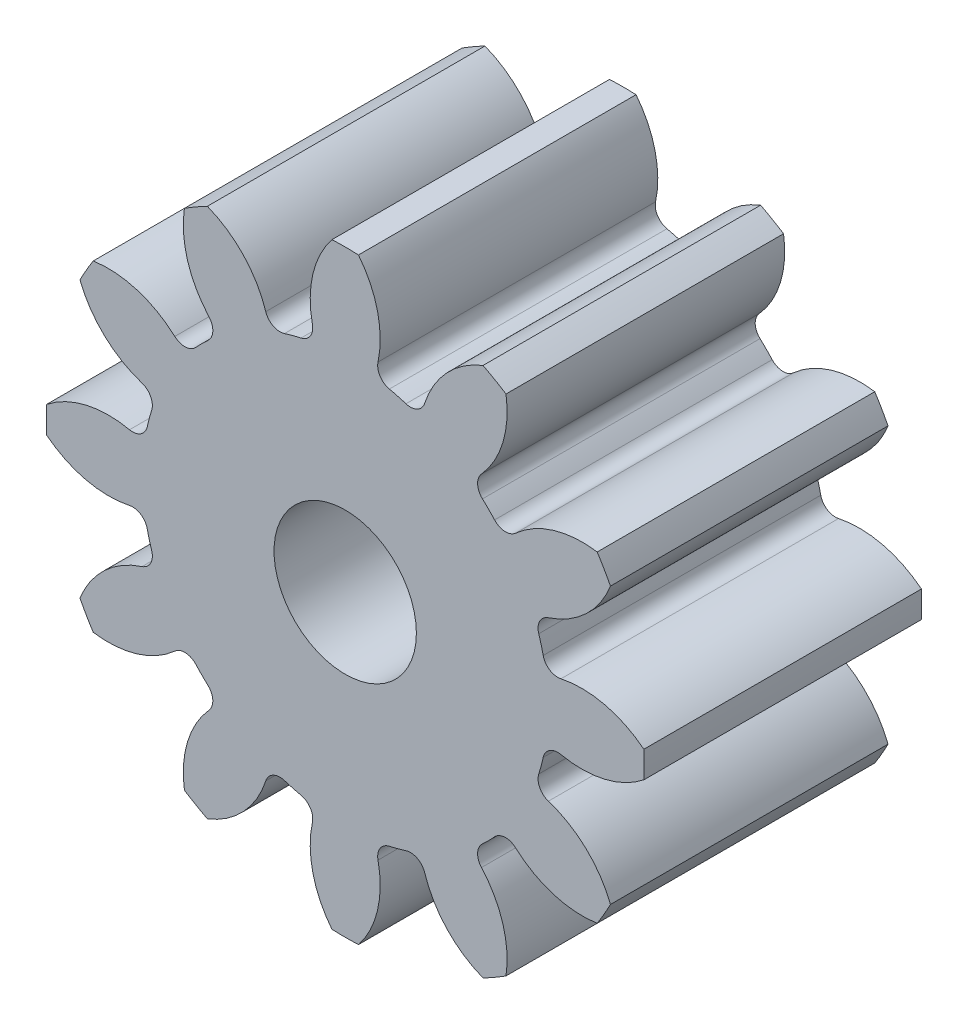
ISO-10303-21;
HEADER;
FILE_DESCRIPTION(('STEP AP214'),'2;1');
FILE_NAME('part.step','',(''),(''),'','','');
FILE_SCHEMA(('AUTOMOTIVE_DESIGN { 1 0 10303 214 1 1 1 1 }'));
ENDSEC;
DATA;
#1=APPLICATION_CONTEXT('core data for automotive mechanical design processes');
#2=APPLICATION_PROTOCOL_DEFINITION('international standard','automotive_design',2000,#1);
#3=PRODUCT_CONTEXT('',#1,'mechanical');
#4=PRODUCT('Part','Part','',(#3));
#5=PRODUCT_RELATED_PRODUCT_CATEGORY('part','',(#4));
#6=PRODUCT_DEFINITION_FORMATION('','',#4);
#7=PRODUCT_DEFINITION_CONTEXT('part definition',#1,'design');
#8=PRODUCT_DEFINITION('design','',#6,#7);
#9=PRODUCT_DEFINITION_SHAPE('','',#8);
#10=(LENGTH_UNIT() NAMED_UNIT(*) SI_UNIT(.MILLI.,.METRE.));
#11=(NAMED_UNIT(*) PLANE_ANGLE_UNIT() SI_UNIT($,.RADIAN.));
#12=(NAMED_UNIT(*) SI_UNIT($,.STERADIAN.) SOLID_ANGLE_UNIT());
#13=UNCERTAINTY_MEASURE_WITH_UNIT(LENGTH_MEASURE(1.E-05),#10,'distance_accuracy_value','');
#14=(GEOMETRIC_REPRESENTATION_CONTEXT(3) GLOBAL_UNCERTAINTY_ASSIGNED_CONTEXT((#13)) GLOBAL_UNIT_ASSIGNED_CONTEXT((#10,
#11,#12)) REPRESENTATION_CONTEXT('',''));
#15=CARTESIAN_POINT('',(0.,0.,0.));
#16=DIRECTION('',(0.,0.,1.));
#17=DIRECTION('',(1.,0.,0.));
#18=AXIS2_PLACEMENT_3D('',#15,#16,#17);
#19=CARTESIAN_POINT('',(-1.37870691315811,-0.560352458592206,3.9));
#20=DIRECTION('',(0.,0.,1.));
#21=DIRECTION('',(1.,0.,0.));
#22=AXIS2_PLACEMENT_3D('',#19,#20,#21);
#23=PLANE('',#22);
#24=CARTESIAN_POINT('',(1.06892215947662,1.8637427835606,3.9));
#25=DIRECTION('',(0.,0.,1.));
#26=DIRECTION('',(0.866025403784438,-0.500000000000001,0.));
#27=AXIS2_PLACEMENT_3D('',#24,#25,#26);
#28=CIRCLE('',#27,1.39935859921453);
#29=CARTESIAN_POINT('',(0.557966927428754,3.16648191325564,3.9));
#30=VERTEX_POINT('',#29);
#31=CARTESIAN_POINT('',(-0.26247358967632,2.2945441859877,3.9));
#32=VERTEX_POINT('',#31);
#33=EDGE_CURVE('E761',#30,#32,#28,.T.);
#34=ORIENTED_EDGE('',*,*,#33,.T.);
#35=CARTESIAN_POINT('',(-0.46227448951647,2.35919401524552,3.9));
#36=DIRECTION('',(0.,0.,1.));
#37=DIRECTION('',(1.,0.,0.));
#38=AXIS2_PLACEMENT_3D('',#35,#36,#37);
#39=CIRCLE('',#38,0.21);
#40=CARTESIAN_POINT('',(-0.525166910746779,2.15883298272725,3.9));
#41=VERTEX_POINT('',#40);
#42=EDGE_CURVE('E837',#32,#41,#39,.F.);
#43=ORIENTED_EDGE('',*,*,#42,.T.);
#44=CARTESIAN_POINT('',(-1.37870691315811,-0.560352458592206,3.9));
#45=DIRECTION('',(0.,0.,1.));
#46=DIRECTION('',(1.,0.,0.));
#47=AXIS2_PLACEMENT_3D('',#44,#45,#46);
#48=CIRCLE('',#47,2.85);
#49=CARTESIAN_POINT('',(-0.758301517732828,2.2213012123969,3.9));
#50=VERTEX_POINT('',#49);
#51=EDGE_CURVE('E781',#41,#50,#48,.T.);
#52=ORIENTED_EDGE('',*,*,#51,.T.);
#53=CARTESIAN_POINT('',(-0.712587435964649,2.42626516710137,3.9));
#54=DIRECTION('',(0.,0.,1.));
#55=DIRECTION('',(1.,0.,0.));
#56=AXIS2_PLACEMENT_3D('',#53,#54,#55);
#57=CIRCLE('',#56,0.21);
#58=CARTESIAN_POINT('',(-0.917945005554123,2.47017722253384,3.9));
#59=VERTEX_POINT('',#58);
#60=EDGE_CURVE('E812',#50,#59,#57,.F.);
#61=ORIENTED_EDGE('',*,*,#60,.T.);
#62=CARTESIAN_POINT('',(-2.28636824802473,2.76279013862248,3.9));
#63=DIRECTION('',(0.,0.,-1.));
#64=DIRECTION('',(-1.,0.,0.));
#65=AXIS2_PLACEMENT_3D('',#62,#63,#64);
#66=CIRCLE('',#65,1.39935859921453);
#67=CARTESIAN_POINT('',(-1.19249847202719,3.63551770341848,3.9));
#68=VERTEX_POINT('',#67);
#69=EDGE_CURVE('E783',#68,#59,#66,.T.);
#70=ORIENTED_EDGE('',*,*,#69,.F.);
#71=CARTESIAN_POINT('',(-1.37870691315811,-0.560352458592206,3.9));
#72=DIRECTION('',(0.,0.,1.));
#73=DIRECTION('',(1.,0.,0.));
#74=AXIS2_PLACEMENT_3D('',#71,#72,#73);
#75=CIRCLE('',#74,4.2);
#76=CARTESIAN_POINT('',(-1.56491535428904,3.63551770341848,3.9));
#77=VERTEX_POINT('',#76);
#78=EDGE_CURVE('E786',#68,#77,#75,.T.);
#79=ORIENTED_EDGE('',*,*,#78,.T.);
#80=CARTESIAN_POINT('',(-0.471045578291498,2.76279013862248,3.9));
#81=DIRECTION('',(0.,0.,1.));
#82=DIRECTION('',(1.,0.,0.));
#83=AXIS2_PLACEMENT_3D('',#80,#81,#82);
#84=CIRCLE('',#83,1.39935859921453);
#85=CARTESIAN_POINT('',(-1.8394688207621,2.47017722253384,3.9));
#86=VERTEX_POINT('',#85);
#87=EDGE_CURVE('E788',#77,#86,#84,.T.);
#88=ORIENTED_EDGE('',*,*,#87,.T.);
#89=CARTESIAN_POINT('',(-2.04482639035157,2.42626516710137,3.9));
#90=DIRECTION('',(0.,0.,1.));
#91=DIRECTION('',(1.,0.,0.));
#92=AXIS2_PLACEMENT_3D('',#89,#90,#91);
#93=CIRCLE('',#92,0.21);
#94=CARTESIAN_POINT('',(-1.9991123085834,2.2213012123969,3.9));
#95=VERTEX_POINT('',#94);
#96=EDGE_CURVE('E816',#86,#95,#93,.F.);
#97=ORIENTED_EDGE('',*,*,#96,.T.);
#98=CARTESIAN_POINT('',(-1.37870691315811,-0.560352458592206,3.9));
#99=DIRECTION('',(0.,0.,-1.));
#100=DIRECTION('',(-1.,0.,0.));
#101=AXIS2_PLACEMENT_3D('',#98,#99,#100);
#102=CIRCLE('',#101,2.85);
#103=CARTESIAN_POINT('',(-2.23224691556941,2.15883298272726,3.9));
#104=VERTEX_POINT('',#103);
#105=EDGE_CURVE('E791',#104,#95,#102,.T.);
#106=ORIENTED_EDGE('',*,*,#105,.F.);
#107=CARTESIAN_POINT('',(-2.29513933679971,2.35919401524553,3.9));
#108=DIRECTION('',(0.,0.,1.));
#109=DIRECTION('',(1.,0.,0.));
#110=AXIS2_PLACEMENT_3D('',#107,#108,#109);
#111=CIRCLE('',#110,0.21);
#112=CARTESIAN_POINT('',(-2.49494023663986,2.29454418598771,3.9));
#113=VERTEX_POINT('',#112);
#114=EDGE_CURVE('E1028',#104,#113,#111,.F.);
#115=ORIENTED_EDGE('',*,*,#114,.T.);
#116=CARTESIAN_POINT('',(-3.82633598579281,1.86374278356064,3.9));
#117=DIRECTION('',(0.,0.,-1.));
#118=DIRECTION('',(-0.866025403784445,-0.499999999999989,0.));
#119=AXIS2_PLACEMENT_3D('',#116,#117,#118);
#120=CIRCLE('',#119,1.39935859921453);
#121=CARTESIAN_POINT('',(-3.31538075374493,3.16648191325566,3.9));
#122=VERTEX_POINT('',#121);
#123=EDGE_CURVE('E514',#122,#113,#120,.T.);
#124=ORIENTED_EDGE('',*,*,#123,.F.);
#125=CARTESIAN_POINT('',(-1.37870691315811,-0.560352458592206,3.9));
#126=DIRECTION('',(0.,0.,1.));
#127=DIRECTION('',(0.866025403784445,0.499999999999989,0.));
#128=AXIS2_PLACEMENT_3D('',#125,#126,#127);
#129=CIRCLE('',#128,4.2);
#130=CARTESIAN_POINT('',(-3.63790323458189,2.98027347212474,3.9));
#131=VERTEX_POINT('',#130);
#132=EDGE_CURVE('E487',#122,#131,#129,.T.);
#133=ORIENTED_EDGE('',*,*,#132,.T.);
#134=CARTESIAN_POINT('',(-2.25422043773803,2.77140411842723,3.9));
#135=DIRECTION('',(0.,0.,1.));
#136=DIRECTION('',(0.866025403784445,0.499999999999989,0.));
#137=AXIS2_PLACEMENT_3D('',#134,#135,#136);
#138=CIRCLE('',#137,1.39935859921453);
#139=CARTESIAN_POINT('',(-3.29300327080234,1.83378227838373,3.9));
#140=VERTEX_POINT('',#139);
#141=EDGE_CURVE('E517',#131,#140,#138,.T.);
#142=ORIENTED_EDGE('',*,*,#141,.T.);
#143=CARTESIAN_POINT('',(-3.44889211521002,1.69307453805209,3.9));
#144=DIRECTION('',(0.,0.,1.));
#145=DIRECTION('',(1.,0.,0.));
#146=AXIS2_PLACEMENT_3D('',#143,#144,#145);
#147=CIRCLE('',#146,0.21);
#148=CARTESIAN_POINT('',(-3.30682058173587,1.53842758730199,3.9));
#149=VERTEX_POINT('',#148);
#150=EDGE_CURVE('E11',#140,#149,#147,.F.);
#151=ORIENTED_EDGE('',*,*,#150,.T.);
#152=CARTESIAN_POINT('',(-1.37870691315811,-0.560352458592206,3.9));
#153=DIRECTION('',(0.,0.,1.));
#154=DIRECTION('',(0.50000000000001,0.866025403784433,0.));
#155=AXIS2_PLACEMENT_3D('',#152,#153,#154);
#156=CIRCLE('',#155,2.85);
#157=CARTESIAN_POINT('',(-3.47748695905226,1.3677612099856,3.9));
#158=VERTEX_POINT('',#157);
#159=EDGE_CURVE('E529',#149,#158,#156,.T.);
#160=ORIENTED_EDGE('',*,*,#159,.T.);
#161=CARTESIAN_POINT('',(-3.63213390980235,1.50983274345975,3.9));
#162=DIRECTION('',(0.,0.,1.));
#163=DIRECTION('',(1.,0.,0.));
#164=AXIS2_PLACEMENT_3D('',#161,#162,#163);
#165=CIRCLE('',#164,0.21);
#166=CARTESIAN_POINT('',(-3.772841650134,1.35394389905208,3.9));
#167=VERTEX_POINT('',#166);
#168=EDGE_CURVE('E1013',#158,#167,#165,.F.);
#169=ORIENTED_EDGE('',*,*,#168,.T.);
#170=CARTESIAN_POINT('',(-4.71046349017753,0.315161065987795,3.9));
#171=DIRECTION('',(0.,0.,-1.));
#172=DIRECTION('',(-0.50000000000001,-0.866025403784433,0.));
#173=AXIS2_PLACEMENT_3D('',#170,#171,#172);
#174=CIRCLE('',#173,1.39935859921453);
#175=CARTESIAN_POINT('',(-4.91933284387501,1.69884386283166,3.9));
#176=VERTEX_POINT('',#175);
#177=EDGE_CURVE('E531',#176,#167,#174,.T.);
#178=ORIENTED_EDGE('',*,*,#177,.F.);
#179=CARTESIAN_POINT('',(-1.37870691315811,-0.560352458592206,3.9));
#180=DIRECTION('',(0.,0.,1.));
#181=DIRECTION('',(0.50000000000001,0.866025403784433,0.));
#182=AXIS2_PLACEMENT_3D('',#179,#180,#181);
#183=CIRCLE('',#182,4.2);
#184=CARTESIAN_POINT('',(-5.10554128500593,1.3763213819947,3.9));
#185=VERTEX_POINT('',#184);
#186=EDGE_CURVE('E534',#176,#185,#183,.T.);
#187=ORIENTED_EDGE('',*,*,#186,.T.);
#188=CARTESIAN_POINT('',(-3.80280215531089,1.88727661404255,3.9));
#189=DIRECTION('',(0.,0.,1.));
#190=DIRECTION('',(0.50000000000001,0.866025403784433,0.));
#191=AXIS2_PLACEMENT_3D('',#188,#189,#190);
#192=CIRCLE('',#191,1.39935859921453);
#193=CARTESIAN_POINT('',(-4.233603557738,0.555880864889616,3.9));
#194=VERTEX_POINT('',#193);
#195=EDGE_CURVE('E536',#185,#194,#192,.T.);
#196=ORIENTED_EDGE('',*,*,#195,.T.);
#197=CARTESIAN_POINT('',(-4.29825338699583,0.356079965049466,3.9));
#198=DIRECTION('',(0.,0.,1.));
#199=DIRECTION('',(1.,0.,0.));
#200=AXIS2_PLACEMENT_3D('',#197,#198,#199);
#201=CIRCLE('',#200,0.21);
#202=CARTESIAN_POINT('',(-4.09789235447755,0.293187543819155,3.9));
#203=VERTEX_POINT('',#202);
#204=EDGE_CURVE('E1017',#194,#203,#201,.F.);
#205=ORIENTED_EDGE('',*,*,#204,.T.);
#206=CARTESIAN_POINT('',(-1.37870691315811,-0.560352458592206,3.9));
#207=DIRECTION('',(0.,0.,1.));
#208=DIRECTION('',(0.,1.,0.));
#209=AXIS2_PLACEMENT_3D('',#206,#207,#208);
#210=CIRCLE('',#209,2.85);
#211=CARTESIAN_POINT('',(-4.16036058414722,0.060052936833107,3.9));
#212=VERTEX_POINT('',#211);
#213=EDGE_CURVE('E554',#203,#212,#210,.T.);
#214=ORIENTED_EDGE('',*,*,#213,.T.);
#215=CARTESIAN_POINT('',(-4.36532453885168,0.105767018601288,3.9));
#216=DIRECTION('',(0.,0.,1.));
#217=DIRECTION('',(1.,0.,0.));
#218=AXIS2_PLACEMENT_3D('',#215,#216,#217);
#219=CIRCLE('',#218,0.21);
#220=CARTESIAN_POINT('',(-4.40923659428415,-0.0995905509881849,3.9));
#221=VERTEX_POINT('',#220);
#222=EDGE_CURVE('E993',#212,#221,#219,.F.);
#223=ORIENTED_EDGE('',*,*,#222,.T.);
#224=CARTESIAN_POINT('',(-4.70184951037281,-1.46801379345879,3.9));
#225=DIRECTION('',(0.,0.,-1.));
#226=DIRECTION('',(0.,-1.,0.));
#227=AXIS2_PLACEMENT_3D('',#224,#225,#226);
#228=CIRCLE('',#227,1.39935859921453);
#229=CARTESIAN_POINT('',(-5.5745770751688,-0.374144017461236,3.9));
#230=VERTEX_POINT('',#229);
#231=EDGE_CURVE('E556',#230,#221,#228,.T.);
#232=ORIENTED_EDGE('',*,*,#231,.F.);
#233=CARTESIAN_POINT('',(-1.37870691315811,-0.560352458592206,3.9));
#234=DIRECTION('',(0.,0.,1.));
#235=DIRECTION('',(0.,1.,0.));
#236=AXIS2_PLACEMENT_3D('',#233,#234,#235);
#237=CIRCLE('',#236,4.2);
#238=CARTESIAN_POINT('',(-5.5745770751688,-0.746560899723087,3.9));
#239=VERTEX_POINT('',#238);
#240=EDGE_CURVE('E559',#230,#239,#237,.T.);
#241=ORIENTED_EDGE('',*,*,#240,.T.);
#242=CARTESIAN_POINT('',(-4.70184951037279,0.347308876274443,3.9));
#243=DIRECTION('',(0.,0.,1.));
#244=DIRECTION('',(0.,1.,0.));
#245=AXIS2_PLACEMENT_3D('',#242,#243,#244);
#246=CIRCLE('',#245,1.39935859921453);
#247=CARTESIAN_POINT('',(-4.40923659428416,-1.02111436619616,3.9));
#248=VERTEX_POINT('',#247);
#249=EDGE_CURVE('E561',#239,#248,#246,.T.);
#250=ORIENTED_EDGE('',*,*,#249,.T.);
#251=CARTESIAN_POINT('',(-4.36532453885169,-1.22647193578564,3.9));
#252=DIRECTION('',(0.,0.,1.));
#253=DIRECTION('',(1.,0.,0.));
#254=AXIS2_PLACEMENT_3D('',#251,#252,#253);
#255=CIRCLE('',#254,0.21);
#256=CARTESIAN_POINT('',(-4.16036058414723,-1.18075785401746,3.9));
#257=VERTEX_POINT('',#256);
#258=EDGE_CURVE('E997',#248,#257,#255,.F.);
#259=ORIENTED_EDGE('',*,*,#258,.T.);
#260=CARTESIAN_POINT('',(-1.37870691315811,-0.560352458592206,3.9));
#261=DIRECTION('',(0.,0.,1.));
#262=DIRECTION('',(-0.499999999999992,0.866025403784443,0.));
#263=AXIS2_PLACEMENT_3D('',#260,#261,#262);
#264=CIRCLE('',#263,2.85);
#265=CARTESIAN_POINT('',(-4.09789235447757,-1.41389246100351,3.9));
#266=VERTEX_POINT('',#265);
#267=EDGE_CURVE('E579',#257,#266,#264,.T.);
#268=ORIENTED_EDGE('',*,*,#267,.T.);
#269=CARTESIAN_POINT('',(-4.29825338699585,-1.47678488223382,3.9));
#270=DIRECTION('',(0.,0.,1.));
#271=DIRECTION('',(1.,0.,0.));
#272=AXIS2_PLACEMENT_3D('',#269,#270,#271);
#273=CIRCLE('',#272,0.21);
#274=CARTESIAN_POINT('',(-4.23360355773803,-1.67658578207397,3.9));
#275=VERTEX_POINT('',#274);
#276=EDGE_CURVE('E973',#266,#275,#273,.F.);
#277=ORIENTED_EDGE('',*,*,#276,.T.);
#278=CARTESIAN_POINT('',(-3.80280215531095,-3.00798153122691,3.9));
#279=DIRECTION('',(0.,0.,-1.));
#280=DIRECTION('',(0.499999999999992,-0.866025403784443,0.));
#281=AXIS2_PLACEMENT_3D('',#278,#279,#280);
#282=CIRCLE('',#281,1.39935859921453);
#283=CARTESIAN_POINT('',(-5.10554128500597,-2.49702629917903,3.9));
#284=VERTEX_POINT('',#283);
#285=EDGE_CURVE('E581',#284,#275,#282,.T.);
#286=ORIENTED_EDGE('',*,*,#285,.F.);
#287=CARTESIAN_POINT('',(-1.37870691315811,-0.560352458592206,3.9));
#288=DIRECTION('',(0.,0.,1.));
#289=DIRECTION('',(-0.499999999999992,0.866025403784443,0.));
#290=AXIS2_PLACEMENT_3D('',#287,#288,#289);
#291=CIRCLE('',#290,4.2);
#292=CARTESIAN_POINT('',(-4.91933284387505,-2.819548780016,3.9));
#293=VERTEX_POINT('',#292);
#294=EDGE_CURVE('E584',#284,#293,#291,.T.);
#295=ORIENTED_EDGE('',*,*,#294,.T.);
#296=CARTESIAN_POINT('',(-4.71046349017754,-1.43586598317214,3.9));
#297=DIRECTION('',(0.,0.,1.));
#298=DIRECTION('',(-0.499999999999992,0.866025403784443,0.));
#299=AXIS2_PLACEMENT_3D('',#296,#297,#298);
#300=CIRCLE('',#299,1.39935859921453);
#301=CARTESIAN_POINT('',(-3.77284165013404,-2.47464881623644,3.9));
#302=VERTEX_POINT('',#301);
#303=EDGE_CURVE('E586',#293,#302,#300,.T.);
#304=ORIENTED_EDGE('',*,*,#303,.T.);
#305=CARTESIAN_POINT('',(-3.6321339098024,-2.63053766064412,3.9));
#306=DIRECTION('',(0.,0.,1.));
#307=DIRECTION('',(1.,0.,0.));
#308=AXIS2_PLACEMENT_3D('',#305,#306,#307);
#309=CIRCLE('',#308,0.21);
#310=CARTESIAN_POINT('',(-3.4774869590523,-2.48846612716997,3.9));
#311=VERTEX_POINT('',#310);
#312=EDGE_CURVE('E977',#302,#311,#309,.F.);
#313=ORIENTED_EDGE('',*,*,#312,.T.);
#314=CARTESIAN_POINT('',(-1.37870691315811,-0.560352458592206,3.9));
#315=DIRECTION('',(0.,0.,1.));
#316=DIRECTION('',(-0.866025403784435,0.500000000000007,0.));
#317=AXIS2_PLACEMENT_3D('',#314,#315,#316);
#318=CIRCLE('',#317,2.85);
#319=CARTESIAN_POINT('',(-3.30682058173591,-2.65913250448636,3.9));
#320=VERTEX_POINT('',#319);
#321=EDGE_CURVE('E604',#311,#320,#318,.T.);
#322=ORIENTED_EDGE('',*,*,#321,.T.);
#323=CARTESIAN_POINT('',(-3.44889211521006,-2.81377945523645,3.9));
#324=DIRECTION('',(0.,0.,1.));
#325=DIRECTION('',(1.,0.,0.));
#326=AXIS2_PLACEMENT_3D('',#323,#324,#325);
#327=CIRCLE('',#326,0.21);
#328=CARTESIAN_POINT('',(-3.29300327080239,-2.9544871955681,3.9));
#329=VERTEX_POINT('',#328);
#330=EDGE_CURVE('E953',#320,#329,#327,.F.);
#331=ORIENTED_EDGE('',*,*,#330,.T.);
#332=CARTESIAN_POINT('',(-2.2542204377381,-3.89210903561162,3.9));
#333=DIRECTION('',(0.,0.,-1.));
#334=DIRECTION('',(0.866025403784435,-0.500000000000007,0.));
#335=AXIS2_PLACEMENT_3D('',#332,#333,#334);
#336=CIRCLE('',#335,1.39935859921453);
#337=CARTESIAN_POINT('',(-3.63790323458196,-4.10097838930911,3.9));
#338=VERTEX_POINT('',#337);
#339=EDGE_CURVE('E606',#338,#329,#336,.T.);
#340=ORIENTED_EDGE('',*,*,#339,.F.);
#341=CARTESIAN_POINT('',(-1.37870691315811,-0.560352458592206,3.9));
#342=DIRECTION('',(0.,0.,1.));
#343=DIRECTION('',(-0.866025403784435,0.500000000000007,0.));
#344=AXIS2_PLACEMENT_3D('',#341,#342,#343);
#345=CIRCLE('',#344,4.2);
#346=CARTESIAN_POINT('',(-3.315380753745,-4.28718683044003,3.9));
#347=VERTEX_POINT('',#346);
#348=EDGE_CURVE('E609',#338,#347,#345,.T.);
#349=ORIENTED_EDGE('',*,*,#348,.T.);
#350=CARTESIAN_POINT('',(-3.82633598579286,-2.984447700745,3.9));
#351=DIRECTION('',(0.,0.,1.));
#352=DIRECTION('',(-0.866025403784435,0.500000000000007,0.));
#353=AXIS2_PLACEMENT_3D('',#350,#351,#352);
#354=CIRCLE('',#353,1.39935859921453);
#355=CARTESIAN_POINT('',(-2.49494023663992,-3.4152491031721,3.9));
#356=VERTEX_POINT('',#355);
#357=EDGE_CURVE('E611',#347,#356,#354,.T.);
#358=ORIENTED_EDGE('',*,*,#357,.T.);
#359=CARTESIAN_POINT('',(-2.29513933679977,-3.47989893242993,3.9));
#360=DIRECTION('',(0.,0.,1.));
#361=DIRECTION('',(1.,0.,0.));
#362=AXIS2_PLACEMENT_3D('',#359,#360,#361);
#363=CIRCLE('',#362,0.21);
#364=CARTESIAN_POINT('',(-2.23224691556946,-3.27953789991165,3.9));
#365=VERTEX_POINT('',#364);
#366=EDGE_CURVE('E957',#356,#365,#363,.F.);
#367=ORIENTED_EDGE('',*,*,#366,.T.);
#368=CARTESIAN_POINT('',(-1.37870691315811,-0.560352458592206,3.9));
#369=DIRECTION('',(0.,0.,1.));
#370=DIRECTION('',(-1.,0.,0.));
#371=AXIS2_PLACEMENT_3D('',#368,#369,#370);
#372=CIRCLE('',#371,2.85);
#373=CARTESIAN_POINT('',(-1.99911230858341,-3.34200612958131,3.9));
#374=VERTEX_POINT('',#373);
#375=EDGE_CURVE('E629',#365,#374,#372,.T.);
#376=ORIENTED_EDGE('',*,*,#375,.T.);
#377=CARTESIAN_POINT('',(-2.0448263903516,-3.54697008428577,3.9));
#378=DIRECTION('',(0.,0.,1.));
#379=DIRECTION('',(1.,0.,0.));
#380=AXIS2_PLACEMENT_3D('',#377,#378,#379);
#381=CIRCLE('',#380,0.21);
#382=CARTESIAN_POINT('',(-1.83946882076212,-3.59088213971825,3.9));
#383=VERTEX_POINT('',#382);
#384=EDGE_CURVE('E933',#374,#383,#381,.F.);
#385=ORIENTED_EDGE('',*,*,#384,.T.);
#386=CARTESIAN_POINT('',(-0.471045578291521,-3.8834950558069,3.9));
#387=DIRECTION('',(0.,0.,-1.));
#388=DIRECTION('',(1.,0.,0.));
#389=AXIS2_PLACEMENT_3D('',#386,#387,#388);
#390=CIRCLE('',#389,1.39935859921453);
#391=CARTESIAN_POINT('',(-1.56491535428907,-4.75622262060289,3.9));
#392=VERTEX_POINT('',#391);
#393=EDGE_CURVE('E631',#392,#383,#390,.T.);
#394=ORIENTED_EDGE('',*,*,#393,.F.);
#395=CARTESIAN_POINT('',(-1.37870691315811,-0.560352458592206,3.9));
#396=DIRECTION('',(0.,0.,1.));
#397=DIRECTION('',(-1.,0.,0.));
#398=AXIS2_PLACEMENT_3D('',#395,#396,#397);
#399=CIRCLE('',#398,4.2);
#400=CARTESIAN_POINT('',(-1.19249847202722,-4.75622262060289,3.9));
#401=VERTEX_POINT('',#400);
#402=EDGE_CURVE('E634',#392,#401,#399,.T.);
#403=ORIENTED_EDGE('',*,*,#402,.T.);
#404=CARTESIAN_POINT('',(-2.28636824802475,-3.88349505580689,3.9));
#405=DIRECTION('',(0.,0.,1.));
#406=DIRECTION('',(-1.,0.,0.));
#407=AXIS2_PLACEMENT_3D('',#404,#405,#406);
#408=CIRCLE('',#407,1.39935859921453);
#409=CARTESIAN_POINT('',(-0.917945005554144,-3.59088213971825,3.9));
#410=VERTEX_POINT('',#409);
#411=EDGE_CURVE('E636',#401,#410,#408,.T.);
#412=ORIENTED_EDGE('',*,*,#411,.T.);
#413=CARTESIAN_POINT('',(-0.712587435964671,-3.54697008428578,3.9));
#414=DIRECTION('',(0.,0.,1.));
#415=DIRECTION('',(1.,0.,0.));
#416=AXIS2_PLACEMENT_3D('',#413,#414,#415);
#417=CIRCLE('',#416,0.21);
#418=CARTESIAN_POINT('',(-0.758301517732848,-3.34200612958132,3.9));
#419=VERTEX_POINT('',#418);
#420=EDGE_CURVE('E937',#410,#419,#417,.F.);
#421=ORIENTED_EDGE('',*,*,#420,.T.);
#422=CARTESIAN_POINT('',(-1.37870691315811,-0.560352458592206,3.9));
#423=DIRECTION('',(0.,0.,1.));
#424=DIRECTION('',(-0.866025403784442,-0.499999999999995,0.));
#425=AXIS2_PLACEMENT_3D('',#422,#423,#424);
#426=CIRCLE('',#425,2.85);
#427=CARTESIAN_POINT('',(-0.525166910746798,-3.27953789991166,3.9));
#428=VERTEX_POINT('',#427);
#429=EDGE_CURVE('E654',#419,#428,#426,.T.);
#430=ORIENTED_EDGE('',*,*,#429,.T.);
#431=CARTESIAN_POINT('',(-0.462274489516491,-3.47989893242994,3.9));
#432=DIRECTION('',(0.,0.,1.));
#433=DIRECTION('',(1.,0.,0.));
#434=AXIS2_PLACEMENT_3D('',#431,#432,#433);
#435=CIRCLE('',#434,0.21);
#436=CARTESIAN_POINT('',(-0.26247358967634,-3.41524910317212,3.9));
#437=VERTEX_POINT('',#436);
#438=EDGE_CURVE('E913',#428,#437,#435,.F.);
#439=ORIENTED_EDGE('',*,*,#438,.T.);
#440=CARTESIAN_POINT('',(1.0689221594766,-2.98444770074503,3.9));
#441=DIRECTION('',(0.,0.,-1.));
#442=DIRECTION('',(0.866025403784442,0.499999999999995,0.));
#443=AXIS2_PLACEMENT_3D('',#440,#441,#442);
#444=CIRCLE('',#443,1.39935859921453);
#445=CARTESIAN_POINT('',(0.557966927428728,-4.28718683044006,3.9));
#446=VERTEX_POINT('',#445);
#447=EDGE_CURVE('E656',#446,#437,#444,.T.);
#448=ORIENTED_EDGE('',*,*,#447,.F.);
#449=CARTESIAN_POINT('',(-1.37870691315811,-0.560352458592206,3.9));
#450=DIRECTION('',(0.,0.,1.));
#451=DIRECTION('',(-0.866025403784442,-0.499999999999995,0.));
#452=AXIS2_PLACEMENT_3D('',#449,#450,#451);
#453=CIRCLE('',#452,4.2);
#454=CARTESIAN_POINT('',(0.880489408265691,-4.10097838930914,3.9));
#455=VERTEX_POINT('',#454);
#456=EDGE_CURVE('E659',#446,#455,#453,.T.);
#457=ORIENTED_EDGE('',*,*,#456,.T.);
#458=CARTESIAN_POINT('',(-0.50319338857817,-3.89210903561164,3.9));
#459=DIRECTION('',(0.,0.,1.));
#460=DIRECTION('',(-0.866025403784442,-0.499999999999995,0.));
#461=AXIS2_PLACEMENT_3D('',#458,#459,#460);
#462=CIRCLE('',#461,1.39935859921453);
#463=CARTESIAN_POINT('',(0.535589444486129,-2.95448719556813,3.9));
#464=VERTEX_POINT('',#463);
#465=EDGE_CURVE('E661',#455,#464,#462,.T.);
#466=ORIENTED_EDGE('',*,*,#465,.T.);
#467=CARTESIAN_POINT('',(0.691478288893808,-2.81377945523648,3.9));
#468=DIRECTION('',(0.,0.,1.));
#469=DIRECTION('',(1.,0.,0.));
#470=AXIS2_PLACEMENT_3D('',#467,#468,#469);
#471=CIRCLE('',#470,0.21);
#472=CARTESIAN_POINT('',(0.549406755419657,-2.65913250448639,3.9));
#473=VERTEX_POINT('',#472);
#474=EDGE_CURVE('E917',#464,#473,#471,.F.);
#475=ORIENTED_EDGE('',*,*,#474,.T.);
#476=CARTESIAN_POINT('',(-1.37870691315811,-0.560352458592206,3.9));
#477=DIRECTION('',(0.,0.,1.));
#478=DIRECTION('',(-0.500000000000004,-0.866025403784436,0.));
#479=AXIS2_PLACEMENT_3D('',#476,#477,#478);
#480=CIRCLE('',#479,2.85);
#481=CARTESIAN_POINT('',(0.720073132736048,-2.48846612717,3.9));
#482=VERTEX_POINT('',#481);
#483=EDGE_CURVE('E679',#473,#482,#480,.T.);
#484=ORIENTED_EDGE('',*,*,#483,.T.);
#485=CARTESIAN_POINT('',(0.874720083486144,-2.63053766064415,3.9));
#486=DIRECTION('',(0.,0.,1.));
#487=DIRECTION('',(1.,0.,0.));
#488=AXIS2_PLACEMENT_3D('',#485,#486,#487);
#489=CIRCLE('',#488,0.21);
#490=CARTESIAN_POINT('',(1.01542782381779,-2.47464881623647,3.9));
#491=VERTEX_POINT('',#490);
#492=EDGE_CURVE('E893',#482,#491,#489,.F.);
#493=ORIENTED_EDGE('',*,*,#492,.T.);
#494=CARTESIAN_POINT('',(1.95304966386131,-1.43586598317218,3.9));
#495=DIRECTION('',(0.,0.,-1.));
#496=DIRECTION('',(0.500000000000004,0.866025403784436,0.));
#497=AXIS2_PLACEMENT_3D('',#494,#495,#496);
#498=CIRCLE('',#497,1.39935859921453);
#499=CARTESIAN_POINT('',(2.1619190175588,-2.81954878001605,3.9));
#500=VERTEX_POINT('',#499);
#501=EDGE_CURVE('E681',#500,#491,#498,.T.);
#502=ORIENTED_EDGE('',*,*,#501,.F.);
#503=CARTESIAN_POINT('',(-1.37870691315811,-0.560352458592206,3.9));
#504=DIRECTION('',(0.,0.,1.));
#505=DIRECTION('',(-0.500000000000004,-0.866025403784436,0.));
#506=AXIS2_PLACEMENT_3D('',#503,#504,#505);
#507=CIRCLE('',#506,4.2);
#508=CARTESIAN_POINT('',(2.34812745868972,-2.49702629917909,3.9));
#509=VERTEX_POINT('',#508);
#510=EDGE_CURVE('E684',#500,#509,#507,.T.);
#511=ORIENTED_EDGE('',*,*,#510,.T.);
#512=CARTESIAN_POINT('',(1.04538832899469,-3.00798153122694,3.9));
#513=DIRECTION('',(0.,0.,1.));
#514=DIRECTION('',(-0.500000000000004,-0.866025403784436,0.));
#515=AXIS2_PLACEMENT_3D('',#512,#513,#514);
#516=CIRCLE('',#515,1.39935859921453);
#517=CARTESIAN_POINT('',(1.47618973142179,-1.67658578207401,3.9));
#518=VERTEX_POINT('',#517);
#519=EDGE_CURVE('E686',#509,#518,#516,.T.);
#520=ORIENTED_EDGE('',*,*,#519,.T.);
#521=CARTESIAN_POINT('',(1.54083956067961,-1.47678488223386,3.9));
#522=DIRECTION('',(0.,0.,1.));
#523=DIRECTION('',(1.,0.,0.));
#524=AXIS2_PLACEMENT_3D('',#521,#522,#523);
#525=CIRCLE('',#524,0.21);
#526=CARTESIAN_POINT('',(1.34047852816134,-1.41389246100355,3.9));
#527=VERTEX_POINT('',#526);
#528=EDGE_CURVE('E897',#518,#527,#525,.F.);
#529=ORIENTED_EDGE('',*,*,#528,.T.);
#530=CARTESIAN_POINT('',(-1.37870691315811,-0.560352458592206,3.9));
#531=DIRECTION('',(0.,0.,1.));
#532=DIRECTION('',(0.,-1.,0.));
#533=AXIS2_PLACEMENT_3D('',#530,#531,#532);
#534=CIRCLE('',#533,2.85);
#535=CARTESIAN_POINT('',(1.402946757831,-1.1807578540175,3.9));
#536=VERTEX_POINT('',#535);
#537=EDGE_CURVE('E704',#527,#536,#534,.T.);
#538=ORIENTED_EDGE('',*,*,#537,.T.);
#539=CARTESIAN_POINT('',(1.60791071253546,-1.22647193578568,3.9));
#540=DIRECTION('',(0.,0.,1.));
#541=DIRECTION('',(1.,0.,0.));
#542=AXIS2_PLACEMENT_3D('',#539,#540,#541);
#543=CIRCLE('',#542,0.21);
#544=CARTESIAN_POINT('',(1.65182276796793,-1.02111436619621,3.9));
#545=VERTEX_POINT('',#544);
#546=EDGE_CURVE('E873',#536,#545,#543,.F.);
#547=ORIENTED_EDGE('',*,*,#546,.T.);
#548=CARTESIAN_POINT('',(1.94443568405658,0.347308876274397,3.9));
#549=DIRECTION('',(0.,0.,-1.));
#550=DIRECTION('',(0.,1.,0.));
#551=AXIS2_PLACEMENT_3D('',#548,#549,#550);
#552=CIRCLE('',#551,1.39935859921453);
#553=CARTESIAN_POINT('',(2.81716324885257,-0.746560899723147,3.9));
#554=VERTEX_POINT('',#553);
#555=EDGE_CURVE('E706',#554,#545,#552,.T.);
#556=ORIENTED_EDGE('',*,*,#555,.F.);
#557=CARTESIAN_POINT('',(-1.37870691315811,-0.560352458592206,3.9));
#558=DIRECTION('',(0.,0.,1.));
#559=DIRECTION('',(0.,-1.,0.));
#560=AXIS2_PLACEMENT_3D('',#557,#558,#559);
#561=CIRCLE('',#560,4.2);
#562=CARTESIAN_POINT('',(2.81716324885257,-0.374144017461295,3.9));
#563=VERTEX_POINT('',#562);
#564=EDGE_CURVE('E709',#554,#563,#561,.T.);
#565=ORIENTED_EDGE('',*,*,#564,.T.);
#566=CARTESIAN_POINT('',(1.94443568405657,-1.46801379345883,3.9));
#567=DIRECTION('',(0.,0.,1.));
#568=DIRECTION('',(0.,-1.,0.));
#569=AXIS2_PLACEMENT_3D('',#566,#567,#568);
#570=CIRCLE('',#569,1.39935859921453);
#571=CARTESIAN_POINT('',(1.65182276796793,-0.0995905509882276,3.9));
#572=VERTEX_POINT('',#571);
#573=EDGE_CURVE('E711',#563,#572,#570,.T.);
#574=ORIENTED_EDGE('',*,*,#573,.T.);
#575=CARTESIAN_POINT('',(1.60791071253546,0.105767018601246,3.9));
#576=DIRECTION('',(0.,0.,1.));
#577=DIRECTION('',(1.,0.,0.));
#578=AXIS2_PLACEMENT_3D('',#575,#576,#577);
#579=CIRCLE('',#578,0.21);
#580=CARTESIAN_POINT('',(1.402946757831,0.060052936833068,3.9));
#581=VERTEX_POINT('',#580);
#582=EDGE_CURVE('E877',#572,#581,#579,.F.);
#583=ORIENTED_EDGE('',*,*,#582,.T.);
#584=CARTESIAN_POINT('',(-1.37870691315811,-0.560352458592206,3.9));
#585=DIRECTION('',(0.,0.,1.));
#586=DIRECTION('',(0.499999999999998,-0.86602540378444,0.));
#587=AXIS2_PLACEMENT_3D('',#584,#585,#586);
#588=CIRCLE('',#587,2.85);
#589=CARTESIAN_POINT('',(1.34047852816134,0.293187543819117,3.9));
#590=VERTEX_POINT('',#589);
#591=EDGE_CURVE('E729',#581,#590,#588,.T.);
#592=ORIENTED_EDGE('',*,*,#591,.T.);
#593=CARTESIAN_POINT('',(1.54083956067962,0.356079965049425,3.9));
#594=DIRECTION('',(0.,0.,1.));
#595=DIRECTION('',(1.,0.,0.));
#596=AXIS2_PLACEMENT_3D('',#593,#594,#595);
#597=CIRCLE('',#596,0.21);
#598=CARTESIAN_POINT('',(1.47618973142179,0.555880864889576,3.9));
#599=VERTEX_POINT('',#598);
#600=EDGE_CURVE('E853',#590,#599,#597,.F.);
#601=ORIENTED_EDGE('',*,*,#600,.T.);
#602=CARTESIAN_POINT('',(1.0453883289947,1.88727661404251,3.9));
#603=DIRECTION('',(0.,0.,-1.));
#604=DIRECTION('',(-0.499999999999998,0.86602540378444,0.));
#605=AXIS2_PLACEMENT_3D('',#602,#603,#604);
#606=CIRCLE('',#605,1.39935859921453);
#607=CARTESIAN_POINT('',(2.34812745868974,1.37632138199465,3.9));
#608=VERTEX_POINT('',#607);
#609=EDGE_CURVE('E731',#608,#599,#606,.T.);
#610=ORIENTED_EDGE('',*,*,#609,.F.);
#611=CARTESIAN_POINT('',(-1.37870691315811,-0.560352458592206,3.9));
#612=DIRECTION('',(0.,0.,1.));
#613=DIRECTION('',(0.499999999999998,-0.86602540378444,0.));
#614=AXIS2_PLACEMENT_3D('',#611,#612,#613);
#615=CIRCLE('',#614,4.2);
#616=CARTESIAN_POINT('',(2.16191901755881,1.69884386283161,3.9));
#617=VERTEX_POINT('',#616);
#618=EDGE_CURVE('E734',#608,#617,#615,.T.);
#619=ORIENTED_EDGE('',*,*,#618,.T.);
#620=CARTESIAN_POINT('',(1.95304966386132,0.315161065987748,3.9));
#621=DIRECTION('',(0.,0.,1.));
#622=DIRECTION('',(0.499999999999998,-0.86602540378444,0.));
#623=AXIS2_PLACEMENT_3D('',#620,#621,#622);
#624=CIRCLE('',#623,1.39935859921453);
#625=CARTESIAN_POINT('',(1.01542782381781,1.35394389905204,3.9));
#626=VERTEX_POINT('',#625);
#627=EDGE_CURVE('E736',#617,#626,#624,.T.);
#628=ORIENTED_EDGE('',*,*,#627,.T.);
#629=CARTESIAN_POINT('',(0.874720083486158,1.50983274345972,3.9));
#630=DIRECTION('',(0.,0.,1.));
#631=DIRECTION('',(1.,0.,0.));
#632=AXIS2_PLACEMENT_3D('',#629,#630,#631);
#633=CIRCLE('',#632,0.21);
#634=CARTESIAN_POINT('',(0.720073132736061,1.36776120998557,3.9));
#635=VERTEX_POINT('',#634);
#636=EDGE_CURVE('E857',#626,#635,#633,.F.);
#637=ORIENTED_EDGE('',*,*,#636,.T.);
#638=CARTESIAN_POINT('',(-1.37870691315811,-0.560352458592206,3.9));
#639=DIRECTION('',(0.,0.,1.));
#640=DIRECTION('',(0.866025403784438,-0.500000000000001,0.));
#641=AXIS2_PLACEMENT_3D('',#638,#639,#640);
#642=CIRCLE('',#641,2.85);
#643=CARTESIAN_POINT('',(0.549406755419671,1.53842758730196,3.9));
#644=VERTEX_POINT('',#643);
#645=EDGE_CURVE('E754',#635,#644,#642,.T.);
#646=ORIENTED_EDGE('',*,*,#645,.T.);
#647=CARTESIAN_POINT('',(0.691478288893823,1.69307453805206,3.9));
#648=DIRECTION('',(0.,0.,1.));
#649=DIRECTION('',(1.,0.,0.));
#650=AXIS2_PLACEMENT_3D('',#647,#648,#649);
#651=CIRCLE('',#650,0.21);
#652=CARTESIAN_POINT('',(0.535589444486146,1.83378227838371,3.9));
#653=VERTEX_POINT('',#652);
#654=EDGE_CURVE('E833',#644,#653,#651,.F.);
#655=ORIENTED_EDGE('',*,*,#654,.T.);
#656=CARTESIAN_POINT('',(-0.503193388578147,2.77140411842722,3.9));
#657=DIRECTION('',(0.,0.,-1.));
#658=DIRECTION('',(-0.866025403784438,0.500000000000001,0.));
#659=AXIS2_PLACEMENT_3D('',#656,#657,#658);
#660=CIRCLE('',#659,1.39935859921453);
#661=CARTESIAN_POINT('',(0.880489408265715,2.98027347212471,3.9));
#662=VERTEX_POINT('',#661);
#663=EDGE_CURVE('E756',#662,#653,#660,.T.);
#664=ORIENTED_EDGE('',*,*,#663,.F.);
#665=CARTESIAN_POINT('',(-1.37870691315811,-0.560352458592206,3.9));
#666=DIRECTION('',(0.,0.,1.));
#667=DIRECTION('',(0.866025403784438,-0.500000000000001,0.));
#668=AXIS2_PLACEMENT_3D('',#665,#666,#667);
#669=CIRCLE('',#668,4.2);
#670=EDGE_CURVE('E759',#662,#30,#669,.T.);
#671=ORIENTED_EDGE('',*,*,#670,.T.);
#672=EDGE_LOOP('',(#34,#43,#52,#61,#70,#79,#88,#97,#106,#115,#124,#133,#142,#151,#160,#169,#178,
#187,#196,#205,#214,#223,#232,#241,#250,#259,#268,#277,#286,#295,#304,#313,#322,#331,#340,#349,
#358,#367,#376,#385,#394,#403,#412,#421,#430,#439,#448,#457,#466,#475,#484,#493,#502,#511,#520,
#529,#538,#547,#556,#565,#574,#583,#592,#601,#610,#619,#628,#637,#646,#655,#664,#671));
#673=FACE_BOUND('',#672,.T.);
#674=CARTESIAN_POINT('',(-1.37870691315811,-0.560352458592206,3.9));
#675=DIRECTION('',(0.,0.,1.));
#676=DIRECTION('',(1.,0.,0.));
#677=AXIS2_PLACEMENT_3D('',#674,#675,#676);
#678=CIRCLE('',#677,1.);
#679=CARTESIAN_POINT('',(-0.378706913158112,-0.560352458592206,3.9));
#680=VERTEX_POINT('',#679);
#681=EDGE_CURVE('E506',#680,#680,#678,.T.);
#682=ORIENTED_EDGE('',*,*,#681,.F.);
#683=EDGE_LOOP('',(#682));
#684=FACE_BOUND('',#683,.T.);
#685=ADVANCED_FACE('F33',(#673,#684),#23,.T.);
#686=CARTESIAN_POINT('',(-1.37870691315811,-0.560352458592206,0.));
#687=DIRECTION('',(0.,0.,1.));
#688=DIRECTION('',(1.,0.,0.));
#689=AXIS2_PLACEMENT_3D('',#686,#687,#688);
#690=PLANE('',#689);
#691=CARTESIAN_POINT('',(-1.37870691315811,-0.560352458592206,0.));
#692=DIRECTION('',(0.,0.,1.));
#693=DIRECTION('',(1.,0.,0.));
#694=AXIS2_PLACEMENT_3D('',#691,#692,#693);
#695=CIRCLE('',#694,2.85);
#696=CARTESIAN_POINT('',(-0.525166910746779,2.15883298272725,0.));
#697=VERTEX_POINT('',#696);
#698=CARTESIAN_POINT('',(-0.758301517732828,2.2213012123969,0.));
#699=VERTEX_POINT('',#698);
#700=EDGE_CURVE('E769',#697,#699,#695,.T.);
#701=ORIENTED_EDGE('',*,*,#700,.F.);
#702=CARTESIAN_POINT('',(-0.46227448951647,2.35919401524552,0.));
#703=DIRECTION('',(0.,0.,1.));
#704=DIRECTION('',(1.,0.,0.));
#705=AXIS2_PLACEMENT_3D('',#702,#703,#704);
#706=CIRCLE('',#705,0.21);
#707=CARTESIAN_POINT('',(-0.26247358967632,2.2945441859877,0.));
#708=VERTEX_POINT('',#707);
#709=EDGE_CURVE('E835',#697,#708,#706,.T.);
#710=ORIENTED_EDGE('',*,*,#709,.T.);
#711=CARTESIAN_POINT('',(1.06892215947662,1.8637427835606,0.));
#712=DIRECTION('',(0.,0.,1.));
#713=DIRECTION('',(0.866025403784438,-0.500000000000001,0.));
#714=AXIS2_PLACEMENT_3D('',#711,#712,#713);
#715=CIRCLE('',#714,1.39935859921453);
#716=CARTESIAN_POINT('',(0.557966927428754,3.16648191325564,0.));
#717=VERTEX_POINT('',#716);
#718=EDGE_CURVE('E751',#717,#708,#715,.T.);
#719=ORIENTED_EDGE('',*,*,#718,.F.);
#720=CARTESIAN_POINT('',(-1.37870691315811,-0.560352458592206,0.));
#721=DIRECTION('',(0.,0.,1.));
#722=DIRECTION('',(0.866025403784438,-0.500000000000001,0.));
#723=AXIS2_PLACEMENT_3D('',#720,#721,#722);
#724=CIRCLE('',#723,4.2);
#725=CARTESIAN_POINT('',(0.880489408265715,2.98027347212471,0.));
#726=VERTEX_POINT('',#725);
#727=EDGE_CURVE('E749',#726,#717,#724,.T.);
#728=ORIENTED_EDGE('',*,*,#727,.F.);
#729=CARTESIAN_POINT('',(-0.503193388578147,2.77140411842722,0.));
#730=DIRECTION('',(0.,0.,-1.));
#731=DIRECTION('',(-0.866025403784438,0.500000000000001,0.));
#732=AXIS2_PLACEMENT_3D('',#729,#730,#731);
#733=CIRCLE('',#732,1.39935859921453);
#734=CARTESIAN_POINT('',(0.535589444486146,1.83378227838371,0.));
#735=VERTEX_POINT('',#734);
#736=EDGE_CURVE('E746',#726,#735,#733,.T.);
#737=ORIENTED_EDGE('',*,*,#736,.T.);
#738=CARTESIAN_POINT('',(0.691478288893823,1.69307453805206,0.));
#739=DIRECTION('',(0.,0.,1.));
#740=DIRECTION('',(1.,0.,0.));
#741=AXIS2_PLACEMENT_3D('',#738,#739,#740);
#742=CIRCLE('',#741,0.21);
#743=CARTESIAN_POINT('',(0.549406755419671,1.53842758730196,0.));
#744=VERTEX_POINT('',#743);
#745=EDGE_CURVE('E830',#735,#744,#742,.T.);
#746=ORIENTED_EDGE('',*,*,#745,.T.);
#747=CARTESIAN_POINT('',(-1.37870691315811,-0.560352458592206,0.));
#748=DIRECTION('',(0.,0.,1.));
#749=DIRECTION('',(0.866025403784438,-0.500000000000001,0.));
#750=AXIS2_PLACEMENT_3D('',#747,#748,#749);
#751=CIRCLE('',#750,2.85);
#752=CARTESIAN_POINT('',(0.720073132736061,1.36776120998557,0.));
#753=VERTEX_POINT('',#752);
#754=EDGE_CURVE('E744',#753,#744,#751,.T.);
#755=ORIENTED_EDGE('',*,*,#754,.F.);
#756=CARTESIAN_POINT('',(0.874720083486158,1.50983274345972,0.));
#757=DIRECTION('',(0.,0.,1.));
#758=DIRECTION('',(1.,0.,0.));
#759=AXIS2_PLACEMENT_3D('',#756,#757,#758);
#760=CIRCLE('',#759,0.21);
#761=CARTESIAN_POINT('',(1.01542782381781,1.35394389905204,0.));
#762=VERTEX_POINT('',#761);
#763=EDGE_CURVE('E855',#753,#762,#760,.T.);
#764=ORIENTED_EDGE('',*,*,#763,.T.);
#765=CARTESIAN_POINT('',(1.95304966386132,0.315161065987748,0.));
#766=DIRECTION('',(0.,0.,1.));
#767=DIRECTION('',(0.499999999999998,-0.86602540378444,0.));
#768=AXIS2_PLACEMENT_3D('',#765,#766,#767);
#769=CIRCLE('',#768,1.39935859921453);
#770=CARTESIAN_POINT('',(2.16191901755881,1.69884386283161,0.));
#771=VERTEX_POINT('',#770);
#772=EDGE_CURVE('E726',#771,#762,#769,.T.);
#773=ORIENTED_EDGE('',*,*,#772,.F.);
#774=CARTESIAN_POINT('',(-1.37870691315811,-0.560352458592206,0.));
#775=DIRECTION('',(0.,0.,1.));
#776=DIRECTION('',(0.499999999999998,-0.86602540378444,0.));
#777=AXIS2_PLACEMENT_3D('',#774,#775,#776);
#778=CIRCLE('',#777,4.2);
#779=CARTESIAN_POINT('',(2.34812745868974,1.37632138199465,0.));
#780=VERTEX_POINT('',#779);
#781=EDGE_CURVE('E724',#780,#771,#778,.T.);
#782=ORIENTED_EDGE('',*,*,#781,.F.);
#783=CARTESIAN_POINT('',(1.0453883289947,1.88727661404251,0.));
#784=DIRECTION('',(0.,0.,-1.));
#785=DIRECTION('',(-0.499999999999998,0.86602540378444,0.));
#786=AXIS2_PLACEMENT_3D('',#783,#784,#785);
#787=CIRCLE('',#786,1.39935859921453);
#788=CARTESIAN_POINT('',(1.47618973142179,0.555880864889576,0.));
#789=VERTEX_POINT('',#788);
#790=EDGE_CURVE('E721',#780,#789,#787,.T.);
#791=ORIENTED_EDGE('',*,*,#790,.T.);
#792=CARTESIAN_POINT('',(1.54083956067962,0.356079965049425,0.));
#793=DIRECTION('',(0.,0.,1.));
#794=DIRECTION('',(1.,0.,0.));
#795=AXIS2_PLACEMENT_3D('',#792,#793,#794);
#796=CIRCLE('',#795,0.21);
#797=CARTESIAN_POINT('',(1.34047852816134,0.293187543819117,0.));
#798=VERTEX_POINT('',#797);
#799=EDGE_CURVE('E850',#789,#798,#796,.T.);
#800=ORIENTED_EDGE('',*,*,#799,.T.);
#801=CARTESIAN_POINT('',(-1.37870691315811,-0.560352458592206,0.));
#802=DIRECTION('',(0.,0.,1.));
#803=DIRECTION('',(0.499999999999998,-0.86602540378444,0.));
#804=AXIS2_PLACEMENT_3D('',#801,#802,#803);
#805=CIRCLE('',#804,2.85);
#806=CARTESIAN_POINT('',(1.402946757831,0.060052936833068,0.));
#807=VERTEX_POINT('',#806);
#808=EDGE_CURVE('E719',#807,#798,#805,.T.);
#809=ORIENTED_EDGE('',*,*,#808,.F.);
#810=CARTESIAN_POINT('',(1.60791071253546,0.105767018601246,0.));
#811=DIRECTION('',(0.,0.,1.));
#812=DIRECTION('',(1.,0.,0.));
#813=AXIS2_PLACEMENT_3D('',#810,#811,#812);
#814=CIRCLE('',#813,0.21);
#815=CARTESIAN_POINT('',(1.65182276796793,-0.0995905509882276,0.));
#816=VERTEX_POINT('',#815);
#817=EDGE_CURVE('E875',#807,#816,#814,.T.);
#818=ORIENTED_EDGE('',*,*,#817,.T.);
#819=CARTESIAN_POINT('',(1.94443568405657,-1.46801379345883,0.));
#820=DIRECTION('',(0.,0.,1.));
#821=DIRECTION('',(0.,-1.,0.));
#822=AXIS2_PLACEMENT_3D('',#819,#820,#821);
#823=CIRCLE('',#822,1.39935859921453);
#824=CARTESIAN_POINT('',(2.81716324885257,-0.374144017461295,0.));
#825=VERTEX_POINT('',#824);
#826=EDGE_CURVE('E701',#825,#816,#823,.T.);
#827=ORIENTED_EDGE('',*,*,#826,.F.);
#828=CARTESIAN_POINT('',(-1.37870691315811,-0.560352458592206,0.));
#829=DIRECTION('',(0.,0.,1.));
#830=DIRECTION('',(0.,-1.,0.));
#831=AXIS2_PLACEMENT_3D('',#828,#829,#830);
#832=CIRCLE('',#831,4.2);
#833=CARTESIAN_POINT('',(2.81716324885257,-0.746560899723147,0.));
#834=VERTEX_POINT('',#833);
#835=EDGE_CURVE('E699',#834,#825,#832,.T.);
#836=ORIENTED_EDGE('',*,*,#835,.F.);
#837=CARTESIAN_POINT('',(1.94443568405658,0.347308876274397,0.));
#838=DIRECTION('',(0.,0.,-1.));
#839=DIRECTION('',(0.,1.,0.));
#840=AXIS2_PLACEMENT_3D('',#837,#838,#839);
#841=CIRCLE('',#840,1.39935859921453);
#842=CARTESIAN_POINT('',(1.65182276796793,-1.02111436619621,0.));
#843=VERTEX_POINT('',#842);
#844=EDGE_CURVE('E696',#834,#843,#841,.T.);
#845=ORIENTED_EDGE('',*,*,#844,.T.);
#846=CARTESIAN_POINT('',(1.60791071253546,-1.22647193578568,0.));
#847=DIRECTION('',(0.,0.,1.));
#848=DIRECTION('',(1.,0.,0.));
#849=AXIS2_PLACEMENT_3D('',#846,#847,#848);
#850=CIRCLE('',#849,0.21);
#851=CARTESIAN_POINT('',(1.402946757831,-1.1807578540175,0.));
#852=VERTEX_POINT('',#851);
#853=EDGE_CURVE('E870',#843,#852,#850,.T.);
#854=ORIENTED_EDGE('',*,*,#853,.T.);
#855=CARTESIAN_POINT('',(-1.37870691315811,-0.560352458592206,0.));
#856=DIRECTION('',(0.,0.,1.));
#857=DIRECTION('',(0.,-1.,0.));
#858=AXIS2_PLACEMENT_3D('',#855,#856,#857);
#859=CIRCLE('',#858,2.85);
#860=CARTESIAN_POINT('',(1.34047852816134,-1.41389246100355,0.));
#861=VERTEX_POINT('',#860);
#862=EDGE_CURVE('E694',#861,#852,#859,.T.);
#863=ORIENTED_EDGE('',*,*,#862,.F.);
#864=CARTESIAN_POINT('',(1.54083956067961,-1.47678488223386,0.));
#865=DIRECTION('',(0.,0.,1.));
#866=DIRECTION('',(1.,0.,0.));
#867=AXIS2_PLACEMENT_3D('',#864,#865,#866);
#868=CIRCLE('',#867,0.21);
#869=CARTESIAN_POINT('',(1.47618973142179,-1.67658578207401,0.));
#870=VERTEX_POINT('',#869);
#871=EDGE_CURVE('E895',#861,#870,#868,.T.);
#872=ORIENTED_EDGE('',*,*,#871,.T.);
#873=CARTESIAN_POINT('',(1.04538832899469,-3.00798153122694,0.));
#874=DIRECTION('',(0.,0.,1.));
#875=DIRECTION('',(-0.500000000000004,-0.866025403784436,0.));
#876=AXIS2_PLACEMENT_3D('',#873,#874,#875);
#877=CIRCLE('',#876,1.39935859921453);
#878=CARTESIAN_POINT('',(2.34812745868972,-2.49702629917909,0.));
#879=VERTEX_POINT('',#878);
#880=EDGE_CURVE('E676',#879,#870,#877,.T.);
#881=ORIENTED_EDGE('',*,*,#880,.F.);
#882=CARTESIAN_POINT('',(-1.37870691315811,-0.560352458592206,0.));
#883=DIRECTION('',(0.,0.,1.));
#884=DIRECTION('',(-0.500000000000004,-0.866025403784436,0.));
#885=AXIS2_PLACEMENT_3D('',#882,#883,#884);
#886=CIRCLE('',#885,4.2);
#887=CARTESIAN_POINT('',(2.1619190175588,-2.81954878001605,0.));
#888=VERTEX_POINT('',#887);
#889=EDGE_CURVE('E674',#888,#879,#886,.T.);
#890=ORIENTED_EDGE('',*,*,#889,.F.);
#891=CARTESIAN_POINT('',(1.95304966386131,-1.43586598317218,0.));
#892=DIRECTION('',(0.,0.,-1.));
#893=DIRECTION('',(0.500000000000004,0.866025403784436,0.));
#894=AXIS2_PLACEMENT_3D('',#891,#892,#893);
#895=CIRCLE('',#894,1.39935859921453);
#896=CARTESIAN_POINT('',(1.01542782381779,-2.47464881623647,0.));
#897=VERTEX_POINT('',#896);
#898=EDGE_CURVE('E671',#888,#897,#895,.T.);
#899=ORIENTED_EDGE('',*,*,#898,.T.);
#900=CARTESIAN_POINT('',(0.874720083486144,-2.63053766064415,0.));
#901=DIRECTION('',(0.,0.,1.));
#902=DIRECTION('',(1.,0.,0.));
#903=AXIS2_PLACEMENT_3D('',#900,#901,#902);
#904=CIRCLE('',#903,0.21);
#905=CARTESIAN_POINT('',(0.720073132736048,-2.48846612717,0.));
#906=VERTEX_POINT('',#905);
#907=EDGE_CURVE('E890',#897,#906,#904,.T.);
#908=ORIENTED_EDGE('',*,*,#907,.T.);
#909=CARTESIAN_POINT('',(-1.37870691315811,-0.560352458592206,0.));
#910=DIRECTION('',(0.,0.,1.));
#911=DIRECTION('',(-0.500000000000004,-0.866025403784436,0.));
#912=AXIS2_PLACEMENT_3D('',#909,#910,#911);
#913=CIRCLE('',#912,2.85);
#914=CARTESIAN_POINT('',(0.549406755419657,-2.65913250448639,0.));
#915=VERTEX_POINT('',#914);
#916=EDGE_CURVE('E669',#915,#906,#913,.T.);
#917=ORIENTED_EDGE('',*,*,#916,.F.);
#918=CARTESIAN_POINT('',(0.691478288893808,-2.81377945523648,0.));
#919=DIRECTION('',(0.,0.,1.));
#920=DIRECTION('',(1.,0.,0.));
#921=AXIS2_PLACEMENT_3D('',#918,#919,#920);
#922=CIRCLE('',#921,0.21);
#923=CARTESIAN_POINT('',(0.535589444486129,-2.95448719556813,0.));
#924=VERTEX_POINT('',#923);
#925=EDGE_CURVE('E915',#915,#924,#922,.T.);
#926=ORIENTED_EDGE('',*,*,#925,.T.);
#927=CARTESIAN_POINT('',(-0.50319338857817,-3.89210903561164,0.));
#928=DIRECTION('',(0.,0.,1.));
#929=DIRECTION('',(-0.866025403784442,-0.499999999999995,0.));
#930=AXIS2_PLACEMENT_3D('',#927,#928,#929);
#931=CIRCLE('',#930,1.39935859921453);
#932=CARTESIAN_POINT('',(0.880489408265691,-4.10097838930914,0.));
#933=VERTEX_POINT('',#932);
#934=EDGE_CURVE('E651',#933,#924,#931,.T.);
#935=ORIENTED_EDGE('',*,*,#934,.F.);
#936=CARTESIAN_POINT('',(-1.37870691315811,-0.560352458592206,0.));
#937=DIRECTION('',(0.,0.,1.));
#938=DIRECTION('',(-0.866025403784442,-0.499999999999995,0.));
#939=AXIS2_PLACEMENT_3D('',#936,#937,#938);
#940=CIRCLE('',#939,4.2);
#941=CARTESIAN_POINT('',(0.557966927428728,-4.28718683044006,0.));
#942=VERTEX_POINT('',#941);
#943=EDGE_CURVE('E649',#942,#933,#940,.T.);
#944=ORIENTED_EDGE('',*,*,#943,.F.);
#945=CARTESIAN_POINT('',(1.0689221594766,-2.98444770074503,0.));
#946=DIRECTION('',(0.,0.,-1.));
#947=DIRECTION('',(0.866025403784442,0.499999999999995,0.));
#948=AXIS2_PLACEMENT_3D('',#945,#946,#947);
#949=CIRCLE('',#948,1.39935859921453);
#950=CARTESIAN_POINT('',(-0.26247358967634,-3.41524910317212,0.));
#951=VERTEX_POINT('',#950);
#952=EDGE_CURVE('E646',#942,#951,#949,.T.);
#953=ORIENTED_EDGE('',*,*,#952,.T.);
#954=CARTESIAN_POINT('',(-0.462274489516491,-3.47989893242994,0.));
#955=DIRECTION('',(0.,0.,1.));
#956=DIRECTION('',(1.,0.,0.));
#957=AXIS2_PLACEMENT_3D('',#954,#955,#956);
#958=CIRCLE('',#957,0.21);
#959=CARTESIAN_POINT('',(-0.525166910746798,-3.27953789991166,0.));
#960=VERTEX_POINT('',#959);
#961=EDGE_CURVE('E910',#951,#960,#958,.T.);
#962=ORIENTED_EDGE('',*,*,#961,.T.);
#963=CARTESIAN_POINT('',(-1.37870691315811,-0.560352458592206,0.));
#964=DIRECTION('',(0.,0.,1.));
#965=DIRECTION('',(-0.866025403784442,-0.499999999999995,0.));
#966=AXIS2_PLACEMENT_3D('',#963,#964,#965);
#967=CIRCLE('',#966,2.85);
#968=CARTESIAN_POINT('',(-0.758301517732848,-3.34200612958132,0.));
#969=VERTEX_POINT('',#968);
#970=EDGE_CURVE('E644',#969,#960,#967,.T.);
#971=ORIENTED_EDGE('',*,*,#970,.F.);
#972=CARTESIAN_POINT('',(-0.712587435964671,-3.54697008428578,0.));
#973=DIRECTION('',(0.,0.,1.));
#974=DIRECTION('',(1.,0.,0.));
#975=AXIS2_PLACEMENT_3D('',#972,#973,#974);
#976=CIRCLE('',#975,0.21);
#977=CARTESIAN_POINT('',(-0.917945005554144,-3.59088213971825,0.));
#978=VERTEX_POINT('',#977);
#979=EDGE_CURVE('E935',#969,#978,#976,.T.);
#980=ORIENTED_EDGE('',*,*,#979,.T.);
#981=CARTESIAN_POINT('',(-2.28636824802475,-3.88349505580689,0.));
#982=DIRECTION('',(0.,0.,1.));
#983=DIRECTION('',(-1.,0.,0.));
#984=AXIS2_PLACEMENT_3D('',#981,#982,#983);
#985=CIRCLE('',#984,1.39935859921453);
#986=CARTESIAN_POINT('',(-1.19249847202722,-4.75622262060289,0.));
#987=VERTEX_POINT('',#986);
#988=EDGE_CURVE('E626',#987,#978,#985,.T.);
#989=ORIENTED_EDGE('',*,*,#988,.F.);
#990=CARTESIAN_POINT('',(-1.37870691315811,-0.560352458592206,0.));
#991=DIRECTION('',(0.,0.,1.));
#992=DIRECTION('',(-1.,0.,0.));
#993=AXIS2_PLACEMENT_3D('',#990,#991,#992);
#994=CIRCLE('',#993,4.2);
#995=CARTESIAN_POINT('',(-1.56491535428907,-4.75622262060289,0.));
#996=VERTEX_POINT('',#995);
#997=EDGE_CURVE('E624',#996,#987,#994,.T.);
#998=ORIENTED_EDGE('',*,*,#997,.F.);
#999=CARTESIAN_POINT('',(-0.471045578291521,-3.8834950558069,0.));
#1000=DIRECTION('',(0.,0.,-1.));
#1001=DIRECTION('',(1.,0.,0.));
#1002=AXIS2_PLACEMENT_3D('',#999,#1000,#1001);
#1003=CIRCLE('',#1002,1.39935859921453);
#1004=CARTESIAN_POINT('',(-1.83946882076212,-3.59088213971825,0.));
#1005=VERTEX_POINT('',#1004);
#1006=EDGE_CURVE('E621',#996,#1005,#1003,.T.);
#1007=ORIENTED_EDGE('',*,*,#1006,.T.);
#1008=CARTESIAN_POINT('',(-2.0448263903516,-3.54697008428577,0.));
#1009=DIRECTION('',(0.,0.,1.));
#1010=DIRECTION('',(1.,0.,0.));
#1011=AXIS2_PLACEMENT_3D('',#1008,#1009,#1010);
#1012=CIRCLE('',#1011,0.21);
#1013=CARTESIAN_POINT('',(-1.99911230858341,-3.34200612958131,0.));
#1014=VERTEX_POINT('',#1013);
#1015=EDGE_CURVE('E930',#1005,#1014,#1012,.T.);
#1016=ORIENTED_EDGE('',*,*,#1015,.T.);
#1017=CARTESIAN_POINT('',(-1.37870691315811,-0.560352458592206,0.));
#1018=DIRECTION('',(0.,0.,1.));
#1019=DIRECTION('',(-1.,0.,0.));
#1020=AXIS2_PLACEMENT_3D('',#1017,#1018,#1019);
#1021=CIRCLE('',#1020,2.85);
#1022=CARTESIAN_POINT('',(-2.23224691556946,-3.27953789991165,0.));
#1023=VERTEX_POINT('',#1022);
#1024=EDGE_CURVE('E619',#1023,#1014,#1021,.T.);
#1025=ORIENTED_EDGE('',*,*,#1024,.F.);
#1026=CARTESIAN_POINT('',(-2.29513933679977,-3.47989893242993,0.));
#1027=DIRECTION('',(0.,0.,1.));
#1028=DIRECTION('',(1.,0.,0.));
#1029=AXIS2_PLACEMENT_3D('',#1026,#1027,#1028);
#1030=CIRCLE('',#1029,0.21);
#1031=CARTESIAN_POINT('',(-2.49494023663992,-3.4152491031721,0.));
#1032=VERTEX_POINT('',#1031);
#1033=EDGE_CURVE('E955',#1023,#1032,#1030,.T.);
#1034=ORIENTED_EDGE('',*,*,#1033,.T.);
#1035=CARTESIAN_POINT('',(-3.82633598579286,-2.984447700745,0.));
#1036=DIRECTION('',(0.,0.,1.));
#1037=DIRECTION('',(-0.866025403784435,0.500000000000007,0.));
#1038=AXIS2_PLACEMENT_3D('',#1035,#1036,#1037);
#1039=CIRCLE('',#1038,1.39935859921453);
#1040=CARTESIAN_POINT('',(-3.315380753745,-4.28718683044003,0.));
#1041=VERTEX_POINT('',#1040);
#1042=EDGE_CURVE('E601',#1041,#1032,#1039,.T.);
#1043=ORIENTED_EDGE('',*,*,#1042,.F.);
#1044=CARTESIAN_POINT('',(-1.37870691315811,-0.560352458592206,0.));
#1045=DIRECTION('',(0.,0.,1.));
#1046=DIRECTION('',(-0.866025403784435,0.500000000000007,0.));
#1047=AXIS2_PLACEMENT_3D('',#1044,#1045,#1046);
#1048=CIRCLE('',#1047,4.2);
#1049=CARTESIAN_POINT('',(-3.63790323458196,-4.10097838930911,0.));
#1050=VERTEX_POINT('',#1049);
#1051=EDGE_CURVE('E599',#1050,#1041,#1048,.T.);
#1052=ORIENTED_EDGE('',*,*,#1051,.F.);
#1053=CARTESIAN_POINT('',(-2.2542204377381,-3.89210903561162,0.));
#1054=DIRECTION('',(0.,0.,-1.));
#1055=DIRECTION('',(0.866025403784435,-0.500000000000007,0.));
#1056=AXIS2_PLACEMENT_3D('',#1053,#1054,#1055);
#1057=CIRCLE('',#1056,1.39935859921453);
#1058=CARTESIAN_POINT('',(-3.29300327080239,-2.9544871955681,0.));
#1059=VERTEX_POINT('',#1058);
#1060=EDGE_CURVE('E596',#1050,#1059,#1057,.T.);
#1061=ORIENTED_EDGE('',*,*,#1060,.T.);
#1062=CARTESIAN_POINT('',(-3.44889211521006,-2.81377945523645,0.));
#1063=DIRECTION('',(0.,0.,1.));
#1064=DIRECTION('',(1.,0.,0.));
#1065=AXIS2_PLACEMENT_3D('',#1062,#1063,#1064);
#1066=CIRCLE('',#1065,0.21);
#1067=CARTESIAN_POINT('',(-3.30682058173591,-2.65913250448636,0.));
#1068=VERTEX_POINT('',#1067);
#1069=EDGE_CURVE('E950',#1059,#1068,#1066,.T.);
#1070=ORIENTED_EDGE('',*,*,#1069,.T.);
#1071=CARTESIAN_POINT('',(-1.37870691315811,-0.560352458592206,0.));
#1072=DIRECTION('',(0.,0.,1.));
#1073=DIRECTION('',(-0.866025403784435,0.500000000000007,0.));
#1074=AXIS2_PLACEMENT_3D('',#1071,#1072,#1073);
#1075=CIRCLE('',#1074,2.85);
#1076=CARTESIAN_POINT('',(-3.4774869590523,-2.48846612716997,0.));
#1077=VERTEX_POINT('',#1076);
#1078=EDGE_CURVE('E594',#1077,#1068,#1075,.T.);
#1079=ORIENTED_EDGE('',*,*,#1078,.F.);
#1080=CARTESIAN_POINT('',(-3.6321339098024,-2.63053766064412,0.));
#1081=DIRECTION('',(0.,0.,1.));
#1082=DIRECTION('',(1.,0.,0.));
#1083=AXIS2_PLACEMENT_3D('',#1080,#1081,#1082);
#1084=CIRCLE('',#1083,0.21);
#1085=CARTESIAN_POINT('',(-3.77284165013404,-2.47464881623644,0.));
#1086=VERTEX_POINT('',#1085);
#1087=EDGE_CURVE('E975',#1077,#1086,#1084,.T.);
#1088=ORIENTED_EDGE('',*,*,#1087,.T.);
#1089=CARTESIAN_POINT('',(-4.71046349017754,-1.43586598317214,0.));
#1090=DIRECTION('',(0.,0.,1.));
#1091=DIRECTION('',(-0.499999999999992,0.866025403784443,0.));
#1092=AXIS2_PLACEMENT_3D('',#1089,#1090,#1091);
#1093=CIRCLE('',#1092,1.39935859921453);
#1094=CARTESIAN_POINT('',(-4.91933284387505,-2.819548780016,0.));
#1095=VERTEX_POINT('',#1094);
#1096=EDGE_CURVE('E576',#1095,#1086,#1093,.T.);
#1097=ORIENTED_EDGE('',*,*,#1096,.F.);
#1098=CARTESIAN_POINT('',(-1.37870691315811,-0.560352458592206,0.));
#1099=DIRECTION('',(0.,0.,1.));
#1100=DIRECTION('',(-0.499999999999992,0.866025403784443,0.));
#1101=AXIS2_PLACEMENT_3D('',#1098,#1099,#1100);
#1102=CIRCLE('',#1101,4.2);
#1103=CARTESIAN_POINT('',(-5.10554128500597,-2.49702629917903,0.));
#1104=VERTEX_POINT('',#1103);
#1105=EDGE_CURVE('E574',#1104,#1095,#1102,.T.);
#1106=ORIENTED_EDGE('',*,*,#1105,.F.);
#1107=CARTESIAN_POINT('',(-3.80280215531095,-3.00798153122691,0.));
#1108=DIRECTION('',(0.,0.,-1.));
#1109=DIRECTION('',(0.499999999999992,-0.866025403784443,0.));
#1110=AXIS2_PLACEMENT_3D('',#1107,#1108,#1109);
#1111=CIRCLE('',#1110,1.39935859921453);
#1112=CARTESIAN_POINT('',(-4.23360355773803,-1.67658578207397,0.));
#1113=VERTEX_POINT('',#1112);
#1114=EDGE_CURVE('E571',#1104,#1113,#1111,.T.);
#1115=ORIENTED_EDGE('',*,*,#1114,.T.);
#1116=CARTESIAN_POINT('',(-4.29825338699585,-1.47678488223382,0.));
#1117=DIRECTION('',(0.,0.,1.));
#1118=DIRECTION('',(1.,0.,0.));
#1119=AXIS2_PLACEMENT_3D('',#1116,#1117,#1118);
#1120=CIRCLE('',#1119,0.21);
#1121=CARTESIAN_POINT('',(-4.09789235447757,-1.41389246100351,0.));
#1122=VERTEX_POINT('',#1121);
#1123=EDGE_CURVE('E970',#1113,#1122,#1120,.T.);
#1124=ORIENTED_EDGE('',*,*,#1123,.T.);
#1125=CARTESIAN_POINT('',(-1.37870691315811,-0.560352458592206,0.));
#1126=DIRECTION('',(0.,0.,1.));
#1127=DIRECTION('',(-0.499999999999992,0.866025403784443,0.));
#1128=AXIS2_PLACEMENT_3D('',#1125,#1126,#1127);
#1129=CIRCLE('',#1128,2.85);
#1130=CARTESIAN_POINT('',(-4.16036058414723,-1.18075785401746,0.));
#1131=VERTEX_POINT('',#1130);
#1132=EDGE_CURVE('E569',#1131,#1122,#1129,.T.);
#1133=ORIENTED_EDGE('',*,*,#1132,.F.);
#1134=CARTESIAN_POINT('',(-4.36532453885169,-1.22647193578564,0.));
#1135=DIRECTION('',(0.,0.,1.));
#1136=DIRECTION('',(1.,0.,0.));
#1137=AXIS2_PLACEMENT_3D('',#1134,#1135,#1136);
#1138=CIRCLE('',#1137,0.21);
#1139=CARTESIAN_POINT('',(-4.40923659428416,-1.02111436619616,0.));
#1140=VERTEX_POINT('',#1139);
#1141=EDGE_CURVE('E995',#1131,#1140,#1138,.T.);
#1142=ORIENTED_EDGE('',*,*,#1141,.T.);
#1143=CARTESIAN_POINT('',(-4.70184951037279,0.347308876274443,0.));
#1144=DIRECTION('',(0.,0.,1.));
#1145=DIRECTION('',(0.,1.,0.));
#1146=AXIS2_PLACEMENT_3D('',#1143,#1144,#1145);
#1147=CIRCLE('',#1146,1.39935859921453);
#1148=CARTESIAN_POINT('',(-5.5745770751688,-0.746560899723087,0.));
#1149=VERTEX_POINT('',#1148);
#1150=EDGE_CURVE('E551',#1149,#1140,#1147,.T.);
#1151=ORIENTED_EDGE('',*,*,#1150,.F.);
#1152=CARTESIAN_POINT('',(-1.37870691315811,-0.560352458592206,0.));
#1153=DIRECTION('',(0.,0.,1.));
#1154=DIRECTION('',(0.,1.,0.));
#1155=AXIS2_PLACEMENT_3D('',#1152,#1153,#1154);
#1156=CIRCLE('',#1155,4.2);
#1157=CARTESIAN_POINT('',(-5.5745770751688,-0.374144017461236,0.));
#1158=VERTEX_POINT('',#1157);
#1159=EDGE_CURVE('E549',#1158,#1149,#1156,.T.);
#1160=ORIENTED_EDGE('',*,*,#1159,.F.);
#1161=CARTESIAN_POINT('',(-4.70184951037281,-1.46801379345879,0.));
#1162=DIRECTION('',(0.,0.,-1.));
#1163=DIRECTION('',(0.,-1.,0.));
#1164=AXIS2_PLACEMENT_3D('',#1161,#1162,#1163);
#1165=CIRCLE('',#1164,1.39935859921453);
#1166=CARTESIAN_POINT('',(-4.40923659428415,-0.0995905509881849,0.));
#1167=VERTEX_POINT('',#1166);
#1168=EDGE_CURVE('E546',#1158,#1167,#1165,.T.);
#1169=ORIENTED_EDGE('',*,*,#1168,.T.);
#1170=CARTESIAN_POINT('',(-4.36532453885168,0.105767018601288,0.));
#1171=DIRECTION('',(0.,0.,1.));
#1172=DIRECTION('',(1.,0.,0.));
#1173=AXIS2_PLACEMENT_3D('',#1170,#1171,#1172);
#1174=CIRCLE('',#1173,0.21);
#1175=CARTESIAN_POINT('',(-4.16036058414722,0.060052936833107,0.));
#1176=VERTEX_POINT('',#1175);
#1177=EDGE_CURVE('E990',#1167,#1176,#1174,.T.);
#1178=ORIENTED_EDGE('',*,*,#1177,.T.);
#1179=CARTESIAN_POINT('',(-1.37870691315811,-0.560352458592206,0.));
#1180=DIRECTION('',(0.,0.,1.));
#1181=DIRECTION('',(0.,1.,0.));
#1182=AXIS2_PLACEMENT_3D('',#1179,#1180,#1181);
#1183=CIRCLE('',#1182,2.85);
#1184=CARTESIAN_POINT('',(-4.09789235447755,0.293187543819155,0.));
#1185=VERTEX_POINT('',#1184);
#1186=EDGE_CURVE('E544',#1185,#1176,#1183,.T.);
#1187=ORIENTED_EDGE('',*,*,#1186,.F.);
#1188=CARTESIAN_POINT('',(-4.29825338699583,0.356079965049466,0.));
#1189=DIRECTION('',(0.,0.,1.));
#1190=DIRECTION('',(1.,0.,0.));
#1191=AXIS2_PLACEMENT_3D('',#1188,#1189,#1190);
#1192=CIRCLE('',#1191,0.21);
#1193=CARTESIAN_POINT('',(-4.233603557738,0.555880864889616,0.));
#1194=VERTEX_POINT('',#1193);
#1195=EDGE_CURVE('E1015',#1185,#1194,#1192,.T.);
#1196=ORIENTED_EDGE('',*,*,#1195,.T.);
#1197=CARTESIAN_POINT('',(-3.80280215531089,1.88727661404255,0.));
#1198=DIRECTION('',(0.,0.,1.));
#1199=DIRECTION('',(0.50000000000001,0.866025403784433,0.));
#1200=AXIS2_PLACEMENT_3D('',#1197,#1198,#1199);
#1201=CIRCLE('',#1200,1.39935859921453);
#1202=CARTESIAN_POINT('',(-5.10554128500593,1.3763213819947,0.));
#1203=VERTEX_POINT('',#1202);
#1204=EDGE_CURVE('E526',#1203,#1194,#1201,.T.);
#1205=ORIENTED_EDGE('',*,*,#1204,.F.);
#1206=CARTESIAN_POINT('',(-1.37870691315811,-0.560352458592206,0.));
#1207=DIRECTION('',(0.,0.,1.));
#1208=DIRECTION('',(0.50000000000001,0.866025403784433,0.));
#1209=AXIS2_PLACEMENT_3D('',#1206,#1207,#1208);
#1210=CIRCLE('',#1209,4.2);
#1211=CARTESIAN_POINT('',(-4.91933284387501,1.69884386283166,0.));
#1212=VERTEX_POINT('',#1211);
#1213=EDGE_CURVE('E524',#1212,#1203,#1210,.T.);
#1214=ORIENTED_EDGE('',*,*,#1213,.F.);
#1215=CARTESIAN_POINT('',(-4.71046349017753,0.315161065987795,0.));
#1216=DIRECTION('',(0.,0.,-1.));
#1217=DIRECTION('',(-0.50000000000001,-0.866025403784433,0.));
#1218=AXIS2_PLACEMENT_3D('',#1215,#1216,#1217);
#1219=CIRCLE('',#1218,1.39935859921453);
#1220=CARTESIAN_POINT('',(-3.772841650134,1.35394389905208,0.));
#1221=VERTEX_POINT('',#1220);
#1222=EDGE_CURVE('E521',#1212,#1221,#1219,.T.);
#1223=ORIENTED_EDGE('',*,*,#1222,.T.);
#1224=CARTESIAN_POINT('',(-3.63213390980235,1.50983274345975,0.));
#1225=DIRECTION('',(0.,0.,1.));
#1226=DIRECTION('',(1.,0.,0.));
#1227=AXIS2_PLACEMENT_3D('',#1224,#1225,#1226);
#1228=CIRCLE('',#1227,0.21);
#1229=CARTESIAN_POINT('',(-3.47748695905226,1.3677612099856,0.));
#1230=VERTEX_POINT('',#1229);
#1231=EDGE_CURVE('E1010',#1221,#1230,#1228,.T.);
#1232=ORIENTED_EDGE('',*,*,#1231,.T.);
#1233=CARTESIAN_POINT('',(-1.37870691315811,-0.560352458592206,0.));
#1234=DIRECTION('',(0.,0.,1.));
#1235=DIRECTION('',(0.50000000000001,0.866025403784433,0.));
#1236=AXIS2_PLACEMENT_3D('',#1233,#1234,#1235);
#1237=CIRCLE('',#1236,2.85);
#1238=CARTESIAN_POINT('',(-3.30682058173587,1.53842758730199,0.));
#1239=VERTEX_POINT('',#1238);
#1240=EDGE_CURVE('E492',#1239,#1230,#1237,.T.);
#1241=ORIENTED_EDGE('',*,*,#1240,.F.);
#1242=CARTESIAN_POINT('',(-3.44889211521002,1.69307453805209,0.));
#1243=DIRECTION('',(0.,0.,1.));
#1244=DIRECTION('',(1.,0.,0.));
#1245=AXIS2_PLACEMENT_3D('',#1242,#1243,#1244);
#1246=CIRCLE('',#1245,0.21);
#1247=CARTESIAN_POINT('',(-3.29300327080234,1.83378227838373,0.));
#1248=VERTEX_POINT('',#1247);
#1249=EDGE_CURVE('E41',#1239,#1248,#1246,.T.);
#1250=ORIENTED_EDGE('',*,*,#1249,.T.);
#1251=CARTESIAN_POINT('',(-2.25422043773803,2.77140411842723,0.));
#1252=DIRECTION('',(0.,0.,1.));
#1253=DIRECTION('',(0.866025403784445,0.499999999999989,0.));
#1254=AXIS2_PLACEMENT_3D('',#1251,#1252,#1253);
#1255=CIRCLE('',#1254,1.39935859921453);
#1256=CARTESIAN_POINT('',(-3.63790323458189,2.98027347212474,0.));
#1257=VERTEX_POINT('',#1256);
#1258=EDGE_CURVE('E500',#1257,#1248,#1255,.T.);
#1259=ORIENTED_EDGE('',*,*,#1258,.F.);
#1260=CARTESIAN_POINT('',(-1.37870691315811,-0.560352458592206,0.));
#1261=DIRECTION('',(0.,0.,1.));
#1262=DIRECTION('',(0.866025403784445,0.499999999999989,0.));
#1263=AXIS2_PLACEMENT_3D('',#1260,#1261,#1262);
#1264=CIRCLE('',#1263,4.2);
#1265=CARTESIAN_POINT('',(-3.31538075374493,3.16648191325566,0.));
#1266=VERTEX_POINT('',#1265);
#1267=EDGE_CURVE('E485',#1266,#1257,#1264,.T.);
#1268=ORIENTED_EDGE('',*,*,#1267,.F.);
#1269=CARTESIAN_POINT('',(-3.82633598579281,1.86374278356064,0.));
#1270=DIRECTION('',(0.,0.,-1.));
#1271=DIRECTION('',(-0.866025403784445,-0.499999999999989,0.));
#1272=AXIS2_PLACEMENT_3D('',#1269,#1270,#1271);
#1273=CIRCLE('',#1272,1.39935859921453);
#1274=CARTESIAN_POINT('',(-2.49494023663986,2.29454418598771,0.));
#1275=VERTEX_POINT('',#1274);
#1276=EDGE_CURVE('E499',#1266,#1275,#1273,.T.);
#1277=ORIENTED_EDGE('',*,*,#1276,.T.);
#1278=CARTESIAN_POINT('',(-2.29513933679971,2.35919401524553,0.));
#1279=DIRECTION('',(0.,0.,1.));
#1280=DIRECTION('',(1.,0.,0.));
#1281=AXIS2_PLACEMENT_3D('',#1278,#1279,#1280);
#1282=CIRCLE('',#1281,0.21);
#1283=CARTESIAN_POINT('',(-2.23224691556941,2.15883298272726,0.));
#1284=VERTEX_POINT('',#1283);
#1285=EDGE_CURVE('E1026',#1275,#1284,#1282,.T.);
#1286=ORIENTED_EDGE('',*,*,#1285,.T.);
#1287=CARTESIAN_POINT('',(-1.37870691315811,-0.560352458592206,0.));
#1288=DIRECTION('',(0.,0.,-1.));
#1289=DIRECTION('',(-1.,0.,0.));
#1290=AXIS2_PLACEMENT_3D('',#1287,#1288,#1289);
#1291=CIRCLE('',#1290,2.85);
#1292=CARTESIAN_POINT('',(-1.9991123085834,2.2213012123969,0.));
#1293=VERTEX_POINT('',#1292);
#1294=EDGE_CURVE('E779',#1284,#1293,#1291,.T.);
#1295=ORIENTED_EDGE('',*,*,#1294,.T.);
#1296=CARTESIAN_POINT('',(-2.04482639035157,2.42626516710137,0.));
#1297=DIRECTION('',(0.,0.,1.));
#1298=DIRECTION('',(1.,0.,0.));
#1299=AXIS2_PLACEMENT_3D('',#1296,#1297,#1298);
#1300=CIRCLE('',#1299,0.21);
#1301=CARTESIAN_POINT('',(-1.8394688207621,2.47017722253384,0.));
#1302=VERTEX_POINT('',#1301);
#1303=EDGE_CURVE('E814',#1293,#1302,#1300,.T.);
#1304=ORIENTED_EDGE('',*,*,#1303,.T.);
#1305=CARTESIAN_POINT('',(-0.471045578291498,2.76279013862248,0.));
#1306=DIRECTION('',(0.,0.,1.));
#1307=DIRECTION('',(1.,0.,0.));
#1308=AXIS2_PLACEMENT_3D('',#1305,#1306,#1307);
#1309=CIRCLE('',#1308,1.39935859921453);
#1310=CARTESIAN_POINT('',(-1.56491535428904,3.63551770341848,0.));
#1311=VERTEX_POINT('',#1310);
#1312=EDGE_CURVE('E776',#1311,#1302,#1309,.T.);
#1313=ORIENTED_EDGE('',*,*,#1312,.F.);
#1314=CARTESIAN_POINT('',(-1.37870691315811,-0.560352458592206,0.));
#1315=DIRECTION('',(0.,0.,1.));
#1316=DIRECTION('',(1.,0.,0.));
#1317=AXIS2_PLACEMENT_3D('',#1314,#1315,#1316);
#1318=CIRCLE('',#1317,4.2);
#1319=CARTESIAN_POINT('',(-1.19249847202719,3.63551770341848,0.));
#1320=VERTEX_POINT('',#1319);
#1321=EDGE_CURVE('E774',#1320,#1311,#1318,.T.);
#1322=ORIENTED_EDGE('',*,*,#1321,.F.);
#1323=CARTESIAN_POINT('',(-2.28636824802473,2.76279013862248,0.));
#1324=DIRECTION('',(0.,0.,-1.));
#1325=DIRECTION('',(-1.,0.,0.));
#1326=AXIS2_PLACEMENT_3D('',#1323,#1324,#1325);
#1327=CIRCLE('',#1326,1.39935859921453);
#1328=CARTESIAN_POINT('',(-0.917945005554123,2.47017722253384,0.));
#1329=VERTEX_POINT('',#1328);
#1330=EDGE_CURVE('E771',#1320,#1329,#1327,.T.);
#1331=ORIENTED_EDGE('',*,*,#1330,.T.);
#1332=CARTESIAN_POINT('',(-0.712587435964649,2.42626516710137,0.));
#1333=DIRECTION('',(0.,0.,1.));
#1334=DIRECTION('',(1.,0.,0.));
#1335=AXIS2_PLACEMENT_3D('',#1332,#1333,#1334);
#1336=CIRCLE('',#1335,0.21);
#1337=EDGE_CURVE('E809',#1329,#699,#1336,.T.);
#1338=ORIENTED_EDGE('',*,*,#1337,.T.);
#1339=EDGE_LOOP('',(#701,#710,#719,#728,#737,#746,#755,#764,#773,#782,#791,#800,#809,#818,#827,
#836,#845,#854,#863,#872,#881,#890,#899,#908,#917,#926,#935,#944,#953,#962,#971,#980,#989,#998,
#1007,#1016,#1025,#1034,#1043,#1052,#1061,#1070,#1079,#1088,#1097,#1106,#1115,#1124,#1133,#1142,
#1151,#1160,#1169,#1178,#1187,#1196,#1205,#1214,#1223,#1232,#1241,#1250,#1259,#1268,#1277,#1286,
#1295,#1304,#1313,#1322,#1331,#1338));
#1340=FACE_BOUND('',#1339,.T.);
#1341=CARTESIAN_POINT('',(-1.37870691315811,-0.560352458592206,0.));
#1342=DIRECTION('',(0.,0.,1.));
#1343=DIRECTION('',(1.,0.,0.));
#1344=AXIS2_PLACEMENT_3D('',#1341,#1342,#1343);
#1345=CIRCLE('',#1344,1.);
#1346=CARTESIAN_POINT('',(-0.378706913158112,-0.560352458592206,0.));
#1347=VERTEX_POINT('',#1346);
#1348=EDGE_CURVE('E509',#1347,#1347,#1345,.T.);
#1349=ORIENTED_EDGE('',*,*,#1348,.T.);
#1350=EDGE_LOOP('',(#1349));
#1351=FACE_BOUND('',#1350,.T.);
#1352=ADVANCED_FACE('F497',(#1340,#1351),#690,.F.);
#1353=CARTESIAN_POINT('',(-1.37870691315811,-0.560352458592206,3.9));
#1354=DIRECTION('',(0.,0.,-1.));
#1355=DIRECTION('',(-1.,0.,0.));
#1356=AXIS2_PLACEMENT_3D('',#1353,#1354,#1355);
#1357=CYLINDRICAL_SURFACE('',#1356,2.85);
#1358=ORIENTED_EDGE('',*,*,#51,.F.);
#1359=DIRECTION('',(0.,0.,-1.));
#1360=VECTOR('',#1359,1.);
#1361=CARTESIAN_POINT('',(-0.525166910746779,2.15883298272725,3.9));
#1362=LINE('',#1361,#1360);
#1363=EDGE_CURVE('E825',#41,#697,#1362,.T.);
#1364=ORIENTED_EDGE('',*,*,#1363,.T.);
#1365=ORIENTED_EDGE('',*,*,#700,.T.);
#1366=DIRECTION('',(0.,0.,-1.));
#1367=VECTOR('',#1366,1.);
#1368=CARTESIAN_POINT('',(-0.758301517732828,2.2213012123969,3.9));
#1369=LINE('',#1368,#1367);
#1370=EDGE_CURVE('E801',#699,#50,#1369,.F.);
#1371=ORIENTED_EDGE('',*,*,#1370,.T.);
#1372=EDGE_LOOP('',(#1358,#1364,#1365,#1371));
#1373=FACE_BOUND('',#1372,.T.);
#1374=ADVANCED_FACE('F35',(#1373),#1357,.T.);
#1375=CARTESIAN_POINT('',(-2.28636824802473,2.76279013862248,3.9));
#1376=DIRECTION('',(0.,0.,-1.));
#1377=DIRECTION('',(-1.,0.,0.));
#1378=AXIS2_PLACEMENT_3D('',#1375,#1376,#1377);
#1379=CYLINDRICAL_SURFACE('',#1378,1.39935859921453);
#1380=ORIENTED_EDGE('',*,*,#69,.T.);
#1381=DIRECTION('',(0.,0.,-1.));
#1382=VECTOR('',#1381,1.);
#1383=CARTESIAN_POINT('',(-0.917945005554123,2.47017722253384,3.9));
#1384=LINE('',#1383,#1382);
#1385=EDGE_CURVE('E798',#59,#1329,#1384,.T.);
#1386=ORIENTED_EDGE('',*,*,#1385,.T.);
#1387=ORIENTED_EDGE('',*,*,#1330,.F.);
#1388=DIRECTION('',(0.,0.,-1.));
#1389=VECTOR('',#1388,1.);
#1390=CARTESIAN_POINT('',(-1.19249847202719,3.63551770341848,3.9));
#1391=LINE('',#1390,#1389);
#1392=EDGE_CURVE('E796',#68,#1320,#1391,.T.);
#1393=ORIENTED_EDGE('',*,*,#1392,.F.);
#1394=EDGE_LOOP('',(#1380,#1386,#1387,#1393));
#1395=FACE_BOUND('',#1394,.T.);
#1396=ADVANCED_FACE('F1057',(#1395),#1379,.T.);
#1397=CARTESIAN_POINT('',(-1.37870691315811,-0.560352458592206,3.9));
#1398=DIRECTION('',(0.,0.,-1.));
#1399=DIRECTION('',(-1.,0.,0.));
#1400=AXIS2_PLACEMENT_3D('',#1397,#1398,#1399);
#1401=CYLINDRICAL_SURFACE('',#1400,4.2);
#1402=ORIENTED_EDGE('',*,*,#1321,.T.);
#1403=DIRECTION('',(0.,0.,-1.));
#1404=VECTOR('',#1403,1.);
#1405=CARTESIAN_POINT('',(-1.56491535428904,3.63551770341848,3.9));
#1406=LINE('',#1405,#1404);
#1407=EDGE_CURVE('E793',#77,#1311,#1406,.T.);
#1408=ORIENTED_EDGE('',*,*,#1407,.F.);
#1409=ORIENTED_EDGE('',*,*,#78,.F.);
#1410=ORIENTED_EDGE('',*,*,#1392,.T.);
#1411=EDGE_LOOP('',(#1402,#1408,#1409,#1410));
#1412=FACE_BOUND('',#1411,.T.);
#1413=ADVANCED_FACE('F1053',(#1412),#1401,.T.);
#1414=CARTESIAN_POINT('',(-0.471045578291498,2.76279013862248,3.9));
#1415=DIRECTION('',(0.,0.,-1.));
#1416=DIRECTION('',(-1.,0.,0.));
#1417=AXIS2_PLACEMENT_3D('',#1414,#1415,#1416);
#1418=CYLINDRICAL_SURFACE('',#1417,1.39935859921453);
#1419=ORIENTED_EDGE('',*,*,#1312,.T.);
#1420=DIRECTION('',(0.,0.,-1.));
#1421=VECTOR('',#1420,1.);
#1422=CARTESIAN_POINT('',(-1.8394688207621,2.47017722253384,3.9));
#1423=LINE('',#1422,#1421);
#1424=EDGE_CURVE('E807',#1302,#86,#1423,.F.);
#1425=ORIENTED_EDGE('',*,*,#1424,.T.);
#1426=ORIENTED_EDGE('',*,*,#87,.F.);
#1427=ORIENTED_EDGE('',*,*,#1407,.T.);
#1428=EDGE_LOOP('',(#1419,#1425,#1426,#1427));
#1429=FACE_BOUND('',#1428,.T.);
#1430=ADVANCED_FACE('F1048',(#1429),#1418,.T.);
#1431=CARTESIAN_POINT('',(-1.37870691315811,-0.560352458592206,3.9));
#1432=DIRECTION('',(0.,0.,-1.));
#1433=DIRECTION('',(-1.,0.,0.));
#1434=AXIS2_PLACEMENT_3D('',#1431,#1432,#1433);
#1435=CYLINDRICAL_SURFACE('',#1434,2.85);
#1436=ORIENTED_EDGE('',*,*,#1294,.F.);
#1437=DIRECTION('',(0.,0.,-1.));
#1438=VECTOR('',#1437,1.);
#1439=CARTESIAN_POINT('',(-2.23224691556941,2.15883298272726,3.9));
#1440=LINE('',#1439,#1438);
#1441=EDGE_CURVE('E1020',#1284,#104,#1440,.F.);
#1442=ORIENTED_EDGE('',*,*,#1441,.T.);
#1443=ORIENTED_EDGE('',*,*,#105,.T.);
#1444=DIRECTION('',(0.,0.,-1.));
#1445=VECTOR('',#1444,1.);
#1446=CARTESIAN_POINT('',(-1.9991123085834,2.2213012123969,3.9));
#1447=LINE('',#1446,#1445);
#1448=EDGE_CURVE('E804',#95,#1293,#1447,.T.);
#1449=ORIENTED_EDGE('',*,*,#1448,.T.);
#1450=EDGE_LOOP('',(#1436,#1442,#1443,#1449));
#1451=FACE_BOUND('',#1450,.T.);
#1452=ADVANCED_FACE('F1039',(#1451),#1435,.T.);
#1453=CARTESIAN_POINT('',(-0.712587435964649,2.42626516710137,3.9));
#1454=DIRECTION('',(0.,0.,1.));
#1455=DIRECTION('',(1.,0.,0.));
#1456=AXIS2_PLACEMENT_3D('',#1453,#1454,#1455);
#1457=CYLINDRICAL_SURFACE('',#1456,0.21);
#1458=ORIENTED_EDGE('',*,*,#60,.F.);
#1459=ORIENTED_EDGE('',*,*,#1370,.F.);
#1460=ORIENTED_EDGE('',*,*,#1337,.F.);
#1461=ORIENTED_EDGE('',*,*,#1385,.F.);
#1462=EDGE_LOOP('',(#1458,#1459,#1460,#1461));
#1463=FACE_BOUND('',#1462,.T.);
#1464=ADVANCED_FACE('F1061',(#1463),#1457,.F.);
#1465=CARTESIAN_POINT('',(-2.04482639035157,2.42626516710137,3.9));
#1466=DIRECTION('',(0.,0.,1.));
#1467=DIRECTION('',(1.,0.,0.));
#1468=AXIS2_PLACEMENT_3D('',#1465,#1466,#1467);
#1469=CYLINDRICAL_SURFACE('',#1468,0.21);
#1470=ORIENTED_EDGE('',*,*,#96,.F.);
#1471=ORIENTED_EDGE('',*,*,#1424,.F.);
#1472=ORIENTED_EDGE('',*,*,#1303,.F.);
#1473=ORIENTED_EDGE('',*,*,#1448,.F.);
#1474=EDGE_LOOP('',(#1470,#1471,#1472,#1473));
#1475=FACE_BOUND('',#1474,.T.);
#1476=ADVANCED_FACE('F1043',(#1475),#1469,.F.);
#1477=CARTESIAN_POINT('',(-1.37870691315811,-0.560352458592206,3.9));
#1478=DIRECTION('',(0.,0.,-1.));
#1479=DIRECTION('',(-1.,0.,0.));
#1480=AXIS2_PLACEMENT_3D('',#1477,#1478,#1479);
#1481=CYLINDRICAL_SURFACE('',#1480,2.85);
#1482=ORIENTED_EDGE('',*,*,#645,.F.);
#1483=DIRECTION('',(0.,0.,-1.));
#1484=VECTOR('',#1483,1.);
#1485=CARTESIAN_POINT('',(0.720073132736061,1.36776120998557,3.9));
#1486=LINE('',#1485,#1484);
#1487=EDGE_CURVE('E845',#635,#753,#1486,.T.);
#1488=ORIENTED_EDGE('',*,*,#1487,.T.);
#1489=ORIENTED_EDGE('',*,*,#754,.T.);
#1490=DIRECTION('',(0.,0.,-1.));
#1491=VECTOR('',#1490,1.);
#1492=CARTESIAN_POINT('',(0.549406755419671,1.53842758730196,3.9));
#1493=LINE('',#1492,#1491);
#1494=EDGE_CURVE('E822',#744,#644,#1493,.F.);
#1495=ORIENTED_EDGE('',*,*,#1494,.T.);
#1496=EDGE_LOOP('',(#1482,#1488,#1489,#1495));
#1497=FACE_BOUND('',#1496,.T.);
#1498=ADVANCED_FACE('F1092',(#1497),#1481,.T.);
#1499=CARTESIAN_POINT('',(-0.503193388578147,2.77140411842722,3.9));
#1500=DIRECTION('',(0.,0.,-1.));
#1501=DIRECTION('',(-1.,0.,0.));
#1502=AXIS2_PLACEMENT_3D('',#1499,#1500,#1501);
#1503=CYLINDRICAL_SURFACE('',#1502,1.39935859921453);
#1504=ORIENTED_EDGE('',*,*,#663,.T.);
#1505=DIRECTION('',(0.,0.,-1.));
#1506=VECTOR('',#1505,1.);
#1507=CARTESIAN_POINT('',(0.535589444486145,1.83378227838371,3.9));
#1508=LINE('',#1507,#1506);
#1509=EDGE_CURVE('E819',#653,#735,#1508,.T.);
#1510=ORIENTED_EDGE('',*,*,#1509,.T.);
#1511=ORIENTED_EDGE('',*,*,#736,.F.);
#1512=DIRECTION('',(0.,0.,-1.));
#1513=VECTOR('',#1512,1.);
#1514=CARTESIAN_POINT('',(0.880489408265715,2.98027347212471,3.9));
#1515=LINE('',#1514,#1513);
#1516=EDGE_CURVE('E767',#662,#726,#1515,.T.);
#1517=ORIENTED_EDGE('',*,*,#1516,.F.);
#1518=EDGE_LOOP('',(#1504,#1510,#1511,#1517));
#1519=FACE_BOUND('',#1518,.T.);
#1520=ADVANCED_FACE('F1082',(#1519),#1503,.T.);
#1521=CARTESIAN_POINT('',(-1.37870691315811,-0.560352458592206,3.9));
#1522=DIRECTION('',(0.,0.,-1.));
#1523=DIRECTION('',(-1.,0.,0.));
#1524=AXIS2_PLACEMENT_3D('',#1521,#1522,#1523);
#1525=CYLINDRICAL_SURFACE('',#1524,4.2);
#1526=ORIENTED_EDGE('',*,*,#727,.T.);
#1527=DIRECTION('',(0.,0.,-1.));
#1528=VECTOR('',#1527,1.);
#1529=CARTESIAN_POINT('',(0.557966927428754,3.16648191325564,3.9));
#1530=LINE('',#1529,#1528);
#1531=EDGE_CURVE('E764',#30,#717,#1530,.T.);
#1532=ORIENTED_EDGE('',*,*,#1531,.F.);
#1533=ORIENTED_EDGE('',*,*,#670,.F.);
#1534=ORIENTED_EDGE('',*,*,#1516,.T.);
#1535=EDGE_LOOP('',(#1526,#1532,#1533,#1534));
#1536=FACE_BOUND('',#1535,.T.);
#1537=ADVANCED_FACE('F1078',(#1536),#1525,.T.);
#1538=CARTESIAN_POINT('',(1.06892215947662,1.8637427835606,3.9));
#1539=DIRECTION('',(0.,0.,-1.));
#1540=DIRECTION('',(-1.,0.,0.));
#1541=AXIS2_PLACEMENT_3D('',#1538,#1539,#1540);
#1542=CYLINDRICAL_SURFACE('',#1541,1.39935859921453);
#1543=ORIENTED_EDGE('',*,*,#718,.T.);
#1544=DIRECTION('',(0.,0.,-1.));
#1545=VECTOR('',#1544,1.);
#1546=CARTESIAN_POINT('',(-0.26247358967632,2.2945441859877,3.9));
#1547=LINE('',#1546,#1545);
#1548=EDGE_CURVE('E828',#708,#32,#1547,.F.);
#1549=ORIENTED_EDGE('',*,*,#1548,.T.);
#1550=ORIENTED_EDGE('',*,*,#33,.F.);
#1551=ORIENTED_EDGE('',*,*,#1531,.T.);
#1552=EDGE_LOOP('',(#1543,#1549,#1550,#1551));
#1553=FACE_BOUND('',#1552,.T.);
#1554=ADVANCED_FACE('F1073',(#1553),#1542,.T.);
#1555=CARTESIAN_POINT('',(-1.37870691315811,-0.560352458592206,3.9));
#1556=DIRECTION('',(0.,0.,-1.));
#1557=DIRECTION('',(-1.,0.,0.));
#1558=AXIS2_PLACEMENT_3D('',#1555,#1556,#1557);
#1559=CYLINDRICAL_SURFACE('',#1558,2.85);
#1560=ORIENTED_EDGE('',*,*,#591,.F.);
#1561=DIRECTION('',(0.,0.,-1.));
#1562=VECTOR('',#1561,1.);
#1563=CARTESIAN_POINT('',(1.402946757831,0.060052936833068,3.9));
#1564=LINE('',#1563,#1562);
#1565=EDGE_CURVE('E865',#581,#807,#1564,.T.);
#1566=ORIENTED_EDGE('',*,*,#1565,.T.);
#1567=ORIENTED_EDGE('',*,*,#808,.T.);
#1568=DIRECTION('',(0.,0.,-1.));
#1569=VECTOR('',#1568,1.);
#1570=CARTESIAN_POINT('',(1.34047852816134,0.293187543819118,3.9));
#1571=LINE('',#1570,#1569);
#1572=EDGE_CURVE('E842',#798,#590,#1571,.F.);
#1573=ORIENTED_EDGE('',*,*,#1572,.T.);
#1574=EDGE_LOOP('',(#1560,#1566,#1567,#1573));
#1575=FACE_BOUND('',#1574,.T.);
#1576=ADVANCED_FACE('F1119',(#1575),#1559,.T.);
#1577=CARTESIAN_POINT('',(1.0453883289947,1.88727661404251,3.9));
#1578=DIRECTION('',(0.,0.,-1.));
#1579=DIRECTION('',(-1.,0.,0.));
#1580=AXIS2_PLACEMENT_3D('',#1577,#1578,#1579);
#1581=CYLINDRICAL_SURFACE('',#1580,1.39935859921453);
#1582=ORIENTED_EDGE('',*,*,#609,.T.);
#1583=DIRECTION('',(0.,0.,-1.));
#1584=VECTOR('',#1583,1.);
#1585=CARTESIAN_POINT('',(1.47618973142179,0.555880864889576,3.9));
#1586=LINE('',#1585,#1584);
#1587=EDGE_CURVE('E839',#599,#789,#1586,.T.);
#1588=ORIENTED_EDGE('',*,*,#1587,.T.);
#1589=ORIENTED_EDGE('',*,*,#790,.F.);
#1590=DIRECTION('',(0.,0.,-1.));
#1591=VECTOR('',#1590,1.);
#1592=CARTESIAN_POINT('',(2.34812745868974,1.37632138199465,3.9));
#1593=LINE('',#1592,#1591);
#1594=EDGE_CURVE('E742',#608,#780,#1593,.T.);
#1595=ORIENTED_EDGE('',*,*,#1594,.F.);
#1596=EDGE_LOOP('',(#1582,#1588,#1589,#1595));
#1597=FACE_BOUND('',#1596,.T.);
#1598=ADVANCED_FACE('F1109',(#1597),#1581,.T.);
#1599=CARTESIAN_POINT('',(-1.37870691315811,-0.560352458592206,3.9));
#1600=DIRECTION('',(0.,0.,-1.));
#1601=DIRECTION('',(-1.,0.,0.));
#1602=AXIS2_PLACEMENT_3D('',#1599,#1600,#1601);
#1603=CYLINDRICAL_SURFACE('',#1602,4.2);
#1604=ORIENTED_EDGE('',*,*,#781,.T.);
#1605=DIRECTION('',(0.,0.,-1.));
#1606=VECTOR('',#1605,1.);
#1607=CARTESIAN_POINT('',(2.16191901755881,1.69884386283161,3.9));
#1608=LINE('',#1607,#1606);
#1609=EDGE_CURVE('E739',#617,#771,#1608,.T.);
#1610=ORIENTED_EDGE('',*,*,#1609,.F.);
#1611=ORIENTED_EDGE('',*,*,#618,.F.);
#1612=ORIENTED_EDGE('',*,*,#1594,.T.);
#1613=EDGE_LOOP('',(#1604,#1610,#1611,#1612));
#1614=FACE_BOUND('',#1613,.T.);
#1615=ADVANCED_FACE('F1105',(#1614),#1603,.T.);
#1616=CARTESIAN_POINT('',(1.95304966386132,0.315161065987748,3.9));
#1617=DIRECTION('',(0.,0.,-1.));
#1618=DIRECTION('',(-1.,0.,0.));
#1619=AXIS2_PLACEMENT_3D('',#1616,#1617,#1618);
#1620=CYLINDRICAL_SURFACE('',#1619,1.39935859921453);
#1621=ORIENTED_EDGE('',*,*,#772,.T.);
#1622=DIRECTION('',(0.,0.,-1.));
#1623=VECTOR('',#1622,1.);
#1624=CARTESIAN_POINT('',(1.01542782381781,1.35394389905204,3.9));
#1625=LINE('',#1624,#1623);
#1626=EDGE_CURVE('E848',#762,#626,#1625,.F.);
#1627=ORIENTED_EDGE('',*,*,#1626,.T.);
#1628=ORIENTED_EDGE('',*,*,#627,.F.);
#1629=ORIENTED_EDGE('',*,*,#1609,.T.);
#1630=EDGE_LOOP('',(#1621,#1627,#1628,#1629));
#1631=FACE_BOUND('',#1630,.T.);
#1632=ADVANCED_FACE('F1100',(#1631),#1620,.T.);
#1633=CARTESIAN_POINT('',(-1.37870691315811,-0.560352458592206,3.9));
#1634=DIRECTION('',(0.,0.,-1.));
#1635=DIRECTION('',(-1.,0.,0.));
#1636=AXIS2_PLACEMENT_3D('',#1633,#1634,#1635);
#1637=CYLINDRICAL_SURFACE('',#1636,2.85);
#1638=ORIENTED_EDGE('',*,*,#537,.F.);
#1639=DIRECTION('',(0.,0.,-1.));
#1640=VECTOR('',#1639,1.);
#1641=CARTESIAN_POINT('',(1.34047852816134,-1.41389246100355,3.9));
#1642=LINE('',#1641,#1640);
#1643=EDGE_CURVE('E885',#527,#861,#1642,.T.);
#1644=ORIENTED_EDGE('',*,*,#1643,.T.);
#1645=ORIENTED_EDGE('',*,*,#862,.T.);
#1646=DIRECTION('',(0.,0.,-1.));
#1647=VECTOR('',#1646,1.);
#1648=CARTESIAN_POINT('',(1.402946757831,-1.1807578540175,3.9));
#1649=LINE('',#1648,#1647);
#1650=EDGE_CURVE('E862',#852,#536,#1649,.F.);
#1651=ORIENTED_EDGE('',*,*,#1650,.T.);
#1652=EDGE_LOOP('',(#1638,#1644,#1645,#1651));
#1653=FACE_BOUND('',#1652,.T.);
#1654=ADVANCED_FACE('F1146',(#1653),#1637,.T.);
#1655=CARTESIAN_POINT('',(1.94443568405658,0.347308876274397,3.9));
#1656=DIRECTION('',(0.,0.,-1.));
#1657=DIRECTION('',(-1.,0.,0.));
#1658=AXIS2_PLACEMENT_3D('',#1655,#1656,#1657);
#1659=CYLINDRICAL_SURFACE('',#1658,1.39935859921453);
#1660=ORIENTED_EDGE('',*,*,#555,.T.);
#1661=DIRECTION('',(0.,0.,-1.));
#1662=VECTOR('',#1661,1.);
#1663=CARTESIAN_POINT('',(1.65182276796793,-1.02111436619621,3.9));
#1664=LINE('',#1663,#1662);
#1665=EDGE_CURVE('E859',#545,#843,#1664,.T.);
#1666=ORIENTED_EDGE('',*,*,#1665,.T.);
#1667=ORIENTED_EDGE('',*,*,#844,.F.);
#1668=DIRECTION('',(0.,0.,-1.));
#1669=VECTOR('',#1668,1.);
#1670=CARTESIAN_POINT('',(2.81716324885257,-0.746560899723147,3.9));
#1671=LINE('',#1670,#1669);
#1672=EDGE_CURVE('E717',#554,#834,#1671,.T.);
#1673=ORIENTED_EDGE('',*,*,#1672,.F.);
#1674=EDGE_LOOP('',(#1660,#1666,#1667,#1673));
#1675=FACE_BOUND('',#1674,.T.);
#1676=ADVANCED_FACE('F1136',(#1675),#1659,.T.);
#1677=CARTESIAN_POINT('',(-1.37870691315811,-0.560352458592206,3.9));
#1678=DIRECTION('',(0.,0.,-1.));
#1679=DIRECTION('',(-1.,0.,0.));
#1680=AXIS2_PLACEMENT_3D('',#1677,#1678,#1679);
#1681=CYLINDRICAL_SURFACE('',#1680,4.2);
#1682=ORIENTED_EDGE('',*,*,#835,.T.);
#1683=DIRECTION('',(0.,0.,-1.));
#1684=VECTOR('',#1683,1.);
#1685=CARTESIAN_POINT('',(2.81716324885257,-0.374144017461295,3.9));
#1686=LINE('',#1685,#1684);
#1687=EDGE_CURVE('E714',#563,#825,#1686,.T.);
#1688=ORIENTED_EDGE('',*,*,#1687,.F.);
#1689=ORIENTED_EDGE('',*,*,#564,.F.);
#1690=ORIENTED_EDGE('',*,*,#1672,.T.);
#1691=EDGE_LOOP('',(#1682,#1688,#1689,#1690));
#1692=FACE_BOUND('',#1691,.T.);
#1693=ADVANCED_FACE('F1132',(#1692),#1681,.T.);
#1694=CARTESIAN_POINT('',(1.94443568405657,-1.46801379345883,3.9));
#1695=DIRECTION('',(0.,0.,-1.));
#1696=DIRECTION('',(-1.,0.,0.));
#1697=AXIS2_PLACEMENT_3D('',#1694,#1695,#1696);
#1698=CYLINDRICAL_SURFACE('',#1697,1.39935859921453);
#1699=ORIENTED_EDGE('',*,*,#826,.T.);
#1700=DIRECTION('',(0.,0.,-1.));
#1701=VECTOR('',#1700,1.);
#1702=CARTESIAN_POINT('',(1.65182276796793,-0.0995905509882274,3.9));
#1703=LINE('',#1702,#1701);
#1704=EDGE_CURVE('E868',#816,#572,#1703,.F.);
#1705=ORIENTED_EDGE('',*,*,#1704,.T.);
#1706=ORIENTED_EDGE('',*,*,#573,.F.);
#1707=ORIENTED_EDGE('',*,*,#1687,.T.);
#1708=EDGE_LOOP('',(#1699,#1705,#1706,#1707));
#1709=FACE_BOUND('',#1708,.T.);
#1710=ADVANCED_FACE('F1127',(#1709),#1698,.T.);
#1711=CARTESIAN_POINT('',(-1.37870691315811,-0.560352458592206,3.9));
#1712=DIRECTION('',(0.,0.,-1.));
#1713=DIRECTION('',(-1.,0.,0.));
#1714=AXIS2_PLACEMENT_3D('',#1711,#1712,#1713);
#1715=CYLINDRICAL_SURFACE('',#1714,2.85);
#1716=ORIENTED_EDGE('',*,*,#483,.F.);
#1717=DIRECTION('',(0.,0.,-1.));
#1718=VECTOR('',#1717,1.);
#1719=CARTESIAN_POINT('',(0.549406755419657,-2.65913250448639,3.9));
#1720=LINE('',#1719,#1718);
#1721=EDGE_CURVE('E905',#473,#915,#1720,.T.);
#1722=ORIENTED_EDGE('',*,*,#1721,.T.);
#1723=ORIENTED_EDGE('',*,*,#916,.T.);
#1724=DIRECTION('',(0.,0.,-1.));
#1725=VECTOR('',#1724,1.);
#1726=CARTESIAN_POINT('',(0.720073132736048,-2.48846612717,3.9));
#1727=LINE('',#1726,#1725);
#1728=EDGE_CURVE('E882',#906,#482,#1727,.F.);
#1729=ORIENTED_EDGE('',*,*,#1728,.T.);
#1730=EDGE_LOOP('',(#1716,#1722,#1723,#1729));
#1731=FACE_BOUND('',#1730,.T.);
#1732=ADVANCED_FACE('F1173',(#1731),#1715,.T.);
#1733=CARTESIAN_POINT('',(1.95304966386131,-1.43586598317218,3.9));
#1734=DIRECTION('',(0.,0.,-1.));
#1735=DIRECTION('',(-1.,0.,0.));
#1736=AXIS2_PLACEMENT_3D('',#1733,#1734,#1735);
#1737=CYLINDRICAL_SURFACE('',#1736,1.39935859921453);
#1738=ORIENTED_EDGE('',*,*,#501,.T.);
#1739=DIRECTION('',(0.,0.,-1.));
#1740=VECTOR('',#1739,1.);
#1741=CARTESIAN_POINT('',(1.01542782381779,-2.47464881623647,3.9));
#1742=LINE('',#1741,#1740);
#1743=EDGE_CURVE('E879',#491,#897,#1742,.T.);
#1744=ORIENTED_EDGE('',*,*,#1743,.T.);
#1745=ORIENTED_EDGE('',*,*,#898,.F.);
#1746=DIRECTION('',(0.,0.,-1.));
#1747=VECTOR('',#1746,1.);
#1748=CARTESIAN_POINT('',(2.1619190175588,-2.81954878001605,3.9));
#1749=LINE('',#1748,#1747);
#1750=EDGE_CURVE('E692',#500,#888,#1749,.T.);
#1751=ORIENTED_EDGE('',*,*,#1750,.F.);
#1752=EDGE_LOOP('',(#1738,#1744,#1745,#1751));
#1753=FACE_BOUND('',#1752,.T.);
#1754=ADVANCED_FACE('F1163',(#1753),#1737,.T.);
#1755=CARTESIAN_POINT('',(-1.37870691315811,-0.560352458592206,3.9));
#1756=DIRECTION('',(0.,0.,-1.));
#1757=DIRECTION('',(-1.,0.,0.));
#1758=AXIS2_PLACEMENT_3D('',#1755,#1756,#1757);
#1759=CYLINDRICAL_SURFACE('',#1758,4.2);
#1760=ORIENTED_EDGE('',*,*,#889,.T.);
#1761=DIRECTION('',(0.,0.,-1.));
#1762=VECTOR('',#1761,1.);
#1763=CARTESIAN_POINT('',(2.34812745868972,-2.49702629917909,3.9));
#1764=LINE('',#1763,#1762);
#1765=EDGE_CURVE('E689',#509,#879,#1764,.T.);
#1766=ORIENTED_EDGE('',*,*,#1765,.F.);
#1767=ORIENTED_EDGE('',*,*,#510,.F.);
#1768=ORIENTED_EDGE('',*,*,#1750,.T.);
#1769=EDGE_LOOP('',(#1760,#1766,#1767,#1768));
#1770=FACE_BOUND('',#1769,.T.);
#1771=ADVANCED_FACE('F1159',(#1770),#1759,.T.);
#1772=CARTESIAN_POINT('',(1.04538832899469,-3.00798153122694,3.9));
#1773=DIRECTION('',(0.,0.,-1.));
#1774=DIRECTION('',(-1.,0.,0.));
#1775=AXIS2_PLACEMENT_3D('',#1772,#1773,#1774);
#1776=CYLINDRICAL_SURFACE('',#1775,1.39935859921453);
#1777=ORIENTED_EDGE('',*,*,#880,.T.);
#1778=DIRECTION('',(0.,0.,-1.));
#1779=VECTOR('',#1778,1.);
#1780=CARTESIAN_POINT('',(1.47618973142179,-1.67658578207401,3.9));
#1781=LINE('',#1780,#1779);
#1782=EDGE_CURVE('E888',#870,#518,#1781,.F.);
#1783=ORIENTED_EDGE('',*,*,#1782,.T.);
#1784=ORIENTED_EDGE('',*,*,#519,.F.);
#1785=ORIENTED_EDGE('',*,*,#1765,.T.);
#1786=EDGE_LOOP('',(#1777,#1783,#1784,#1785));
#1787=FACE_BOUND('',#1786,.T.);
#1788=ADVANCED_FACE('F1154',(#1787),#1776,.T.);
#1789=CARTESIAN_POINT('',(-1.37870691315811,-0.560352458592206,3.9));
#1790=DIRECTION('',(0.,0.,-1.));
#1791=DIRECTION('',(-1.,0.,0.));
#1792=AXIS2_PLACEMENT_3D('',#1789,#1790,#1791);
#1793=CYLINDRICAL_SURFACE('',#1792,2.85);
#1794=ORIENTED_EDGE('',*,*,#429,.F.);
#1795=DIRECTION('',(0.,0.,-1.));
#1796=VECTOR('',#1795,1.);
#1797=CARTESIAN_POINT('',(-0.758301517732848,-3.34200612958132,3.9));
#1798=LINE('',#1797,#1796);
#1799=EDGE_CURVE('E925',#419,#969,#1798,.T.);
#1800=ORIENTED_EDGE('',*,*,#1799,.T.);
#1801=ORIENTED_EDGE('',*,*,#970,.T.);
#1802=DIRECTION('',(0.,0.,-1.));
#1803=VECTOR('',#1802,1.);
#1804=CARTESIAN_POINT('',(-0.525166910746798,-3.27953789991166,3.9));
#1805=LINE('',#1804,#1803);
#1806=EDGE_CURVE('E902',#960,#428,#1805,.F.);
#1807=ORIENTED_EDGE('',*,*,#1806,.T.);
#1808=EDGE_LOOP('',(#1794,#1800,#1801,#1807));
#1809=FACE_BOUND('',#1808,.T.);
#1810=ADVANCED_FACE('F1200',(#1809),#1793,.T.);
#1811=CARTESIAN_POINT('',(1.0689221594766,-2.98444770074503,3.9));
#1812=DIRECTION('',(0.,0.,-1.));
#1813=DIRECTION('',(-1.,0.,0.));
#1814=AXIS2_PLACEMENT_3D('',#1811,#1812,#1813);
#1815=CYLINDRICAL_SURFACE('',#1814,1.39935859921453);
#1816=ORIENTED_EDGE('',*,*,#447,.T.);
#1817=DIRECTION('',(0.,0.,-1.));
#1818=VECTOR('',#1817,1.);
#1819=CARTESIAN_POINT('',(-0.26247358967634,-3.41524910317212,3.9));
#1820=LINE('',#1819,#1818);
#1821=EDGE_CURVE('E899',#437,#951,#1820,.T.);
#1822=ORIENTED_EDGE('',*,*,#1821,.T.);
#1823=ORIENTED_EDGE('',*,*,#952,.F.);
#1824=DIRECTION('',(0.,0.,-1.));
#1825=VECTOR('',#1824,1.);
#1826=CARTESIAN_POINT('',(0.557966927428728,-4.28718683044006,3.9));
#1827=LINE('',#1826,#1825);
#1828=EDGE_CURVE('E667',#446,#942,#1827,.T.);
#1829=ORIENTED_EDGE('',*,*,#1828,.F.);
#1830=EDGE_LOOP('',(#1816,#1822,#1823,#1829));
#1831=FACE_BOUND('',#1830,.T.);
#1832=ADVANCED_FACE('F1190',(#1831),#1815,.T.);
#1833=CARTESIAN_POINT('',(-1.37870691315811,-0.560352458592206,3.9));
#1834=DIRECTION('',(0.,0.,-1.));
#1835=DIRECTION('',(-1.,0.,0.));
#1836=AXIS2_PLACEMENT_3D('',#1833,#1834,#1835);
#1837=CYLINDRICAL_SURFACE('',#1836,4.2);
#1838=ORIENTED_EDGE('',*,*,#943,.T.);
#1839=DIRECTION('',(0.,0.,-1.));
#1840=VECTOR('',#1839,1.);
#1841=CARTESIAN_POINT('',(0.880489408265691,-4.10097838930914,3.9));
#1842=LINE('',#1841,#1840);
#1843=EDGE_CURVE('E664',#455,#933,#1842,.T.);
#1844=ORIENTED_EDGE('',*,*,#1843,.F.);
#1845=ORIENTED_EDGE('',*,*,#456,.F.);
#1846=ORIENTED_EDGE('',*,*,#1828,.T.);
#1847=EDGE_LOOP('',(#1838,#1844,#1845,#1846));
#1848=FACE_BOUND('',#1847,.T.);
#1849=ADVANCED_FACE('F1186',(#1848),#1837,.T.);
#1850=CARTESIAN_POINT('',(-0.50319338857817,-3.89210903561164,3.9));
#1851=DIRECTION('',(0.,0.,-1.));
#1852=DIRECTION('',(-1.,0.,0.));
#1853=AXIS2_PLACEMENT_3D('',#1850,#1851,#1852);
#1854=CYLINDRICAL_SURFACE('',#1853,1.39935859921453);
#1855=ORIENTED_EDGE('',*,*,#934,.T.);
#1856=DIRECTION('',(0.,0.,-1.));
#1857=VECTOR('',#1856,1.);
#1858=CARTESIAN_POINT('',(0.535589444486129,-2.95448719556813,3.9));
#1859=LINE('',#1858,#1857);
#1860=EDGE_CURVE('E908',#924,#464,#1859,.F.);
#1861=ORIENTED_EDGE('',*,*,#1860,.T.);
#1862=ORIENTED_EDGE('',*,*,#465,.F.);
#1863=ORIENTED_EDGE('',*,*,#1843,.T.);
#1864=EDGE_LOOP('',(#1855,#1861,#1862,#1863));
#1865=FACE_BOUND('',#1864,.T.);
#1866=ADVANCED_FACE('F1181',(#1865),#1854,.T.);
#1867=CARTESIAN_POINT('',(-1.37870691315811,-0.560352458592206,3.9));
#1868=DIRECTION('',(0.,0.,-1.));
#1869=DIRECTION('',(-1.,0.,0.));
#1870=AXIS2_PLACEMENT_3D('',#1867,#1868,#1869);
#1871=CYLINDRICAL_SURFACE('',#1870,2.85);
#1872=ORIENTED_EDGE('',*,*,#375,.F.);
#1873=DIRECTION('',(0.,0.,-1.));
#1874=VECTOR('',#1873,1.);
#1875=CARTESIAN_POINT('',(-2.23224691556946,-3.27953789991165,3.9));
#1876=LINE('',#1875,#1874);
#1877=EDGE_CURVE('E945',#365,#1023,#1876,.T.);
#1878=ORIENTED_EDGE('',*,*,#1877,.T.);
#1879=ORIENTED_EDGE('',*,*,#1024,.T.);
#1880=DIRECTION('',(0.,0.,-1.));
#1881=VECTOR('',#1880,1.);
#1882=CARTESIAN_POINT('',(-1.99911230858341,-3.34200612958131,3.9));
#1883=LINE('',#1882,#1881);
#1884=EDGE_CURVE('E922',#1014,#374,#1883,.F.);
#1885=ORIENTED_EDGE('',*,*,#1884,.T.);
#1886=EDGE_LOOP('',(#1872,#1878,#1879,#1885));
#1887=FACE_BOUND('',#1886,.T.);
#1888=ADVANCED_FACE('F1227',(#1887),#1871,.T.);
#1889=CARTESIAN_POINT('',(-0.471045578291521,-3.8834950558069,3.9));
#1890=DIRECTION('',(0.,0.,-1.));
#1891=DIRECTION('',(-1.,0.,0.));
#1892=AXIS2_PLACEMENT_3D('',#1889,#1890,#1891);
#1893=CYLINDRICAL_SURFACE('',#1892,1.39935859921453);
#1894=ORIENTED_EDGE('',*,*,#393,.T.);
#1895=DIRECTION('',(0.,0.,-1.));
#1896=VECTOR('',#1895,1.);
#1897=CARTESIAN_POINT('',(-1.83946882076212,-3.59088213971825,3.9));
#1898=LINE('',#1897,#1896);
#1899=EDGE_CURVE('E919',#383,#1005,#1898,.T.);
#1900=ORIENTED_EDGE('',*,*,#1899,.T.);
#1901=ORIENTED_EDGE('',*,*,#1006,.F.);
#1902=DIRECTION('',(0.,0.,-1.));
#1903=VECTOR('',#1902,1.);
#1904=CARTESIAN_POINT('',(-1.56491535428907,-4.75622262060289,3.9));
#1905=LINE('',#1904,#1903);
#1906=EDGE_CURVE('E642',#392,#996,#1905,.T.);
#1907=ORIENTED_EDGE('',*,*,#1906,.F.);
#1908=EDGE_LOOP('',(#1894,#1900,#1901,#1907));
#1909=FACE_BOUND('',#1908,.T.);
#1910=ADVANCED_FACE('F1217',(#1909),#1893,.T.);
#1911=CARTESIAN_POINT('',(-1.37870691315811,-0.560352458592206,3.9));
#1912=DIRECTION('',(0.,0.,-1.));
#1913=DIRECTION('',(-1.,0.,0.));
#1914=AXIS2_PLACEMENT_3D('',#1911,#1912,#1913);
#1915=CYLINDRICAL_SURFACE('',#1914,4.2);
#1916=ORIENTED_EDGE('',*,*,#997,.T.);
#1917=DIRECTION('',(0.,0.,-1.));
#1918=VECTOR('',#1917,1.);
#1919=CARTESIAN_POINT('',(-1.19249847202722,-4.75622262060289,3.9));
#1920=LINE('',#1919,#1918);
#1921=EDGE_CURVE('E639',#401,#987,#1920,.T.);
#1922=ORIENTED_EDGE('',*,*,#1921,.F.);
#1923=ORIENTED_EDGE('',*,*,#402,.F.);
#1924=ORIENTED_EDGE('',*,*,#1906,.T.);
#1925=EDGE_LOOP('',(#1916,#1922,#1923,#1924));
#1926=FACE_BOUND('',#1925,.T.);
#1927=ADVANCED_FACE('F1213',(#1926),#1915,.T.);
#1928=CARTESIAN_POINT('',(-2.28636824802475,-3.88349505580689,3.9));
#1929=DIRECTION('',(0.,0.,-1.));
#1930=DIRECTION('',(-1.,0.,0.));
#1931=AXIS2_PLACEMENT_3D('',#1928,#1929,#1930);
#1932=CYLINDRICAL_SURFACE('',#1931,1.39935859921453);
#1933=ORIENTED_EDGE('',*,*,#988,.T.);
#1934=DIRECTION('',(0.,0.,-1.));
#1935=VECTOR('',#1934,1.);
#1936=CARTESIAN_POINT('',(-0.917945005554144,-3.59088213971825,3.9));
#1937=LINE('',#1936,#1935);
#1938=EDGE_CURVE('E928',#978,#410,#1937,.F.);
#1939=ORIENTED_EDGE('',*,*,#1938,.T.);
#1940=ORIENTED_EDGE('',*,*,#411,.F.);
#1941=ORIENTED_EDGE('',*,*,#1921,.T.);
#1942=EDGE_LOOP('',(#1933,#1939,#1940,#1941));
#1943=FACE_BOUND('',#1942,.T.);
#1944=ADVANCED_FACE('F1208',(#1943),#1932,.T.);
#1945=CARTESIAN_POINT('',(-1.37870691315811,-0.560352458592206,3.9));
#1946=DIRECTION('',(0.,0.,-1.));
#1947=DIRECTION('',(-1.,0.,0.));
#1948=AXIS2_PLACEMENT_3D('',#1945,#1946,#1947);
#1949=CYLINDRICAL_SURFACE('',#1948,2.85);
#1950=ORIENTED_EDGE('',*,*,#321,.F.);
#1951=DIRECTION('',(0.,0.,-1.));
#1952=VECTOR('',#1951,1.);
#1953=CARTESIAN_POINT('',(-3.4774869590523,-2.48846612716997,3.9));
#1954=LINE('',#1953,#1952);
#1955=EDGE_CURVE('E965',#311,#1077,#1954,.T.);
#1956=ORIENTED_EDGE('',*,*,#1955,.T.);
#1957=ORIENTED_EDGE('',*,*,#1078,.T.);
#1958=DIRECTION('',(0.,0.,-1.));
#1959=VECTOR('',#1958,1.);
#1960=CARTESIAN_POINT('',(-3.30682058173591,-2.65913250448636,3.9));
#1961=LINE('',#1960,#1959);
#1962=EDGE_CURVE('E942',#1068,#320,#1961,.F.);
#1963=ORIENTED_EDGE('',*,*,#1962,.T.);
#1964=EDGE_LOOP('',(#1950,#1956,#1957,#1963));
#1965=FACE_BOUND('',#1964,.T.);
#1966=ADVANCED_FACE('F1254',(#1965),#1949,.T.);
#1967=CARTESIAN_POINT('',(-2.2542204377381,-3.89210903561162,3.9));
#1968=DIRECTION('',(0.,0.,-1.));
#1969=DIRECTION('',(-1.,0.,0.));
#1970=AXIS2_PLACEMENT_3D('',#1967,#1968,#1969);
#1971=CYLINDRICAL_SURFACE('',#1970,1.39935859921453);
#1972=ORIENTED_EDGE('',*,*,#339,.T.);
#1973=DIRECTION('',(0.,0.,-1.));
#1974=VECTOR('',#1973,1.);
#1975=CARTESIAN_POINT('',(-3.29300327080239,-2.9544871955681,3.9));
#1976=LINE('',#1975,#1974);
#1977=EDGE_CURVE('E939',#329,#1059,#1976,.T.);
#1978=ORIENTED_EDGE('',*,*,#1977,.T.);
#1979=ORIENTED_EDGE('',*,*,#1060,.F.);
#1980=DIRECTION('',(0.,0.,-1.));
#1981=VECTOR('',#1980,1.);
#1982=CARTESIAN_POINT('',(-3.63790323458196,-4.10097838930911,3.9));
#1983=LINE('',#1982,#1981);
#1984=EDGE_CURVE('E617',#338,#1050,#1983,.T.);
#1985=ORIENTED_EDGE('',*,*,#1984,.F.);
#1986=EDGE_LOOP('',(#1972,#1978,#1979,#1985));
#1987=FACE_BOUND('',#1986,.T.);
#1988=ADVANCED_FACE('F1244',(#1987),#1971,.T.);
#1989=CARTESIAN_POINT('',(-1.37870691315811,-0.560352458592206,3.9));
#1990=DIRECTION('',(0.,0.,-1.));
#1991=DIRECTION('',(-1.,0.,0.));
#1992=AXIS2_PLACEMENT_3D('',#1989,#1990,#1991);
#1993=CYLINDRICAL_SURFACE('',#1992,4.2);
#1994=ORIENTED_EDGE('',*,*,#1051,.T.);
#1995=DIRECTION('',(0.,0.,-1.));
#1996=VECTOR('',#1995,1.);
#1997=CARTESIAN_POINT('',(-3.315380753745,-4.28718683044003,3.9));
#1998=LINE('',#1997,#1996);
#1999=EDGE_CURVE('E614',#347,#1041,#1998,.T.);
#2000=ORIENTED_EDGE('',*,*,#1999,.F.);
#2001=ORIENTED_EDGE('',*,*,#348,.F.);
#2002=ORIENTED_EDGE('',*,*,#1984,.T.);
#2003=EDGE_LOOP('',(#1994,#2000,#2001,#2002));
#2004=FACE_BOUND('',#2003,.T.);
#2005=ADVANCED_FACE('F1240',(#2004),#1993,.T.);
#2006=CARTESIAN_POINT('',(-3.82633598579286,-2.984447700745,3.9));
#2007=DIRECTION('',(0.,0.,-1.));
#2008=DIRECTION('',(-1.,0.,0.));
#2009=AXIS2_PLACEMENT_3D('',#2006,#2007,#2008);
#2010=CYLINDRICAL_SURFACE('',#2009,1.39935859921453);
#2011=ORIENTED_EDGE('',*,*,#1042,.T.);
#2012=DIRECTION('',(0.,0.,-1.));
#2013=VECTOR('',#2012,1.);
#2014=CARTESIAN_POINT('',(-2.49494023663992,-3.4152491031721,3.9));
#2015=LINE('',#2014,#2013);
#2016=EDGE_CURVE('E948',#1032,#356,#2015,.F.);
#2017=ORIENTED_EDGE('',*,*,#2016,.T.);
#2018=ORIENTED_EDGE('',*,*,#357,.F.);
#2019=ORIENTED_EDGE('',*,*,#1999,.T.);
#2020=EDGE_LOOP('',(#2011,#2017,#2018,#2019));
#2021=FACE_BOUND('',#2020,.T.);
#2022=ADVANCED_FACE('F1235',(#2021),#2010,.T.);
#2023=CARTESIAN_POINT('',(-1.37870691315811,-0.560352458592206,3.9));
#2024=DIRECTION('',(0.,0.,-1.));
#2025=DIRECTION('',(-1.,0.,0.));
#2026=AXIS2_PLACEMENT_3D('',#2023,#2024,#2025);
#2027=CYLINDRICAL_SURFACE('',#2026,2.85);
#2028=ORIENTED_EDGE('',*,*,#267,.F.);
#2029=DIRECTION('',(0.,0.,-1.));
#2030=VECTOR('',#2029,1.);
#2031=CARTESIAN_POINT('',(-4.16036058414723,-1.18075785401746,3.9));
#2032=LINE('',#2031,#2030);
#2033=EDGE_CURVE('E985',#257,#1131,#2032,.T.);
#2034=ORIENTED_EDGE('',*,*,#2033,.T.);
#2035=ORIENTED_EDGE('',*,*,#1132,.T.);
#2036=DIRECTION('',(0.,0.,-1.));
#2037=VECTOR('',#2036,1.);
#2038=CARTESIAN_POINT('',(-4.09789235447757,-1.41389246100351,3.9));
#2039=LINE('',#2038,#2037);
#2040=EDGE_CURVE('E962',#1122,#266,#2039,.F.);
#2041=ORIENTED_EDGE('',*,*,#2040,.T.);
#2042=EDGE_LOOP('',(#2028,#2034,#2035,#2041));
#2043=FACE_BOUND('',#2042,.T.);
#2044=ADVANCED_FACE('F1281',(#2043),#2027,.T.);
#2045=CARTESIAN_POINT('',(-3.80280215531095,-3.00798153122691,3.9));
#2046=DIRECTION('',(0.,0.,-1.));
#2047=DIRECTION('',(-1.,0.,0.));
#2048=AXIS2_PLACEMENT_3D('',#2045,#2046,#2047);
#2049=CYLINDRICAL_SURFACE('',#2048,1.39935859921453);
#2050=ORIENTED_EDGE('',*,*,#285,.T.);
#2051=DIRECTION('',(0.,0.,-1.));
#2052=VECTOR('',#2051,1.);
#2053=CARTESIAN_POINT('',(-4.23360355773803,-1.67658578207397,3.9));
#2054=LINE('',#2053,#2052);
#2055=EDGE_CURVE('E959',#275,#1113,#2054,.T.);
#2056=ORIENTED_EDGE('',*,*,#2055,.T.);
#2057=ORIENTED_EDGE('',*,*,#1114,.F.);
#2058=DIRECTION('',(0.,0.,-1.));
#2059=VECTOR('',#2058,1.);
#2060=CARTESIAN_POINT('',(-5.10554128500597,-2.49702629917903,3.9));
#2061=LINE('',#2060,#2059);
#2062=EDGE_CURVE('E592',#284,#1104,#2061,.T.);
#2063=ORIENTED_EDGE('',*,*,#2062,.F.);
#2064=EDGE_LOOP('',(#2050,#2056,#2057,#2063));
#2065=FACE_BOUND('',#2064,.T.);
#2066=ADVANCED_FACE('F1271',(#2065),#2049,.T.);
#2067=CARTESIAN_POINT('',(-1.37870691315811,-0.560352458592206,3.9));
#2068=DIRECTION('',(0.,0.,-1.));
#2069=DIRECTION('',(-1.,0.,0.));
#2070=AXIS2_PLACEMENT_3D('',#2067,#2068,#2069);
#2071=CYLINDRICAL_SURFACE('',#2070,4.2);
#2072=ORIENTED_EDGE('',*,*,#1105,.T.);
#2073=DIRECTION('',(0.,0.,-1.));
#2074=VECTOR('',#2073,1.);
#2075=CARTESIAN_POINT('',(-4.91933284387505,-2.819548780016,3.9));
#2076=LINE('',#2075,#2074);
#2077=EDGE_CURVE('E589',#293,#1095,#2076,.T.);
#2078=ORIENTED_EDGE('',*,*,#2077,.F.);
#2079=ORIENTED_EDGE('',*,*,#294,.F.);
#2080=ORIENTED_EDGE('',*,*,#2062,.T.);
#2081=EDGE_LOOP('',(#2072,#2078,#2079,#2080));
#2082=FACE_BOUND('',#2081,.T.);
#2083=ADVANCED_FACE('F1267',(#2082),#2071,.T.);
#2084=CARTESIAN_POINT('',(-4.71046349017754,-1.43586598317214,3.9));
#2085=DIRECTION('',(0.,0.,-1.));
#2086=DIRECTION('',(-1.,0.,0.));
#2087=AXIS2_PLACEMENT_3D('',#2084,#2085,#2086);
#2088=CYLINDRICAL_SURFACE('',#2087,1.39935859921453);
#2089=ORIENTED_EDGE('',*,*,#1096,.T.);
#2090=DIRECTION('',(0.,0.,-1.));
#2091=VECTOR('',#2090,1.);
#2092=CARTESIAN_POINT('',(-3.77284165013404,-2.47464881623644,3.9));
#2093=LINE('',#2092,#2091);
#2094=EDGE_CURVE('E968',#1086,#302,#2093,.F.);
#2095=ORIENTED_EDGE('',*,*,#2094,.T.);
#2096=ORIENTED_EDGE('',*,*,#303,.F.);
#2097=ORIENTED_EDGE('',*,*,#2077,.T.);
#2098=EDGE_LOOP('',(#2089,#2095,#2096,#2097));
#2099=FACE_BOUND('',#2098,.T.);
#2100=ADVANCED_FACE('F1262',(#2099),#2088,.T.);
#2101=CARTESIAN_POINT('',(-1.37870691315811,-0.560352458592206,3.9));
#2102=DIRECTION('',(0.,0.,-1.));
#2103=DIRECTION('',(-1.,0.,0.));
#2104=AXIS2_PLACEMENT_3D('',#2101,#2102,#2103);
#2105=CYLINDRICAL_SURFACE('',#2104,2.85);
#2106=ORIENTED_EDGE('',*,*,#213,.F.);
#2107=DIRECTION('',(0.,0.,-1.));
#2108=VECTOR('',#2107,1.);
#2109=CARTESIAN_POINT('',(-4.09789235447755,0.293187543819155,3.9));
#2110=LINE('',#2109,#2108);
#2111=EDGE_CURVE('E1005',#203,#1185,#2110,.T.);
#2112=ORIENTED_EDGE('',*,*,#2111,.T.);
#2113=ORIENTED_EDGE('',*,*,#1186,.T.);
#2114=DIRECTION('',(0.,0.,-1.));
#2115=VECTOR('',#2114,1.);
#2116=CARTESIAN_POINT('',(-4.16036058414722,0.060052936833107,3.9));
#2117=LINE('',#2116,#2115);
#2118=EDGE_CURVE('E982',#1176,#212,#2117,.F.);
#2119=ORIENTED_EDGE('',*,*,#2118,.T.);
#2120=EDGE_LOOP('',(#2106,#2112,#2113,#2119));
#2121=FACE_BOUND('',#2120,.T.);
#2122=ADVANCED_FACE('F1308',(#2121),#2105,.T.);
#2123=CARTESIAN_POINT('',(-4.70184951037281,-1.46801379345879,3.9));
#2124=DIRECTION('',(0.,0.,-1.));
#2125=DIRECTION('',(-1.,0.,0.));
#2126=AXIS2_PLACEMENT_3D('',#2123,#2124,#2125);
#2127=CYLINDRICAL_SURFACE('',#2126,1.39935859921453);
#2128=ORIENTED_EDGE('',*,*,#231,.T.);
#2129=DIRECTION('',(0.,0.,-1.));
#2130=VECTOR('',#2129,1.);
#2131=CARTESIAN_POINT('',(-4.40923659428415,-0.0995905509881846,3.9));
#2132=LINE('',#2131,#2130);
#2133=EDGE_CURVE('E979',#221,#1167,#2132,.T.);
#2134=ORIENTED_EDGE('',*,*,#2133,.T.);
#2135=ORIENTED_EDGE('',*,*,#1168,.F.);
#2136=DIRECTION('',(0.,0.,-1.));
#2137=VECTOR('',#2136,1.);
#2138=CARTESIAN_POINT('',(-5.5745770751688,-0.374144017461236,3.9));
#2139=LINE('',#2138,#2137);
#2140=EDGE_CURVE('E567',#230,#1158,#2139,.T.);
#2141=ORIENTED_EDGE('',*,*,#2140,.F.);
#2142=EDGE_LOOP('',(#2128,#2134,#2135,#2141));
#2143=FACE_BOUND('',#2142,.T.);
#2144=ADVANCED_FACE('F1298',(#2143),#2127,.T.);
#2145=CARTESIAN_POINT('',(-1.37870691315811,-0.560352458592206,3.9));
#2146=DIRECTION('',(0.,0.,-1.));
#2147=DIRECTION('',(-1.,0.,0.));
#2148=AXIS2_PLACEMENT_3D('',#2145,#2146,#2147);
#2149=CYLINDRICAL_SURFACE('',#2148,4.2);
#2150=ORIENTED_EDGE('',*,*,#1159,.T.);
#2151=DIRECTION('',(0.,0.,-1.));
#2152=VECTOR('',#2151,1.);
#2153=CARTESIAN_POINT('',(-5.5745770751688,-0.746560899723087,3.9));
#2154=LINE('',#2153,#2152);
#2155=EDGE_CURVE('E564',#239,#1149,#2154,.T.);
#2156=ORIENTED_EDGE('',*,*,#2155,.F.);
#2157=ORIENTED_EDGE('',*,*,#240,.F.);
#2158=ORIENTED_EDGE('',*,*,#2140,.T.);
#2159=EDGE_LOOP('',(#2150,#2156,#2157,#2158));
#2160=FACE_BOUND('',#2159,.T.);
#2161=ADVANCED_FACE('F1294',(#2160),#2149,.T.);
#2162=CARTESIAN_POINT('',(-4.70184951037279,0.347308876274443,3.9));
#2163=DIRECTION('',(0.,0.,-1.));
#2164=DIRECTION('',(-1.,0.,0.));
#2165=AXIS2_PLACEMENT_3D('',#2162,#2163,#2164);
#2166=CYLINDRICAL_SURFACE('',#2165,1.39935859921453);
#2167=ORIENTED_EDGE('',*,*,#1150,.T.);
#2168=DIRECTION('',(0.,0.,-1.));
#2169=VECTOR('',#2168,1.);
#2170=CARTESIAN_POINT('',(-4.40923659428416,-1.02111436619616,3.9));
#2171=LINE('',#2170,#2169);
#2172=EDGE_CURVE('E988',#1140,#248,#2171,.F.);
#2173=ORIENTED_EDGE('',*,*,#2172,.T.);
#2174=ORIENTED_EDGE('',*,*,#249,.F.);
#2175=ORIENTED_EDGE('',*,*,#2155,.T.);
#2176=EDGE_LOOP('',(#2167,#2173,#2174,#2175));
#2177=FACE_BOUND('',#2176,.T.);
#2178=ADVANCED_FACE('F1289',(#2177),#2166,.T.);
#2179=CARTESIAN_POINT('',(-1.37870691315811,-0.560352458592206,3.9));
#2180=DIRECTION('',(0.,0.,-1.));
#2181=DIRECTION('',(-1.,0.,0.));
#2182=AXIS2_PLACEMENT_3D('',#2179,#2180,#2181);
#2183=CYLINDRICAL_SURFACE('',#2182,2.85);
#2184=ORIENTED_EDGE('',*,*,#159,.F.);
#2185=DIRECTION('',(0.,0.,-1.));
#2186=VECTOR('',#2185,1.);
#2187=CARTESIAN_POINT('',(-3.30682058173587,1.53842758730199,3.9));
#2188=LINE('',#2187,#2186);
#2189=EDGE_CURVE('E1022',#149,#1239,#2188,.T.);
#2190=ORIENTED_EDGE('',*,*,#2189,.T.);
#2191=ORIENTED_EDGE('',*,*,#1240,.T.);
#2192=DIRECTION('',(0.,0.,-1.));
#2193=VECTOR('',#2192,1.);
#2194=CARTESIAN_POINT('',(-3.47748695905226,1.3677612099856,3.9));
#2195=LINE('',#2194,#2193);
#2196=EDGE_CURVE('E1002',#1230,#158,#2195,.F.);
#2197=ORIENTED_EDGE('',*,*,#2196,.T.);
#2198=EDGE_LOOP('',(#2184,#2190,#2191,#2197));
#2199=FACE_BOUND('',#2198,.T.);
#2200=ADVANCED_FACE('F1333',(#2199),#2183,.T.);
#2201=CARTESIAN_POINT('',(-4.71046349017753,0.315161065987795,3.9));
#2202=DIRECTION('',(0.,0.,-1.));
#2203=DIRECTION('',(-1.,0.,0.));
#2204=AXIS2_PLACEMENT_3D('',#2201,#2202,#2203);
#2205=CYLINDRICAL_SURFACE('',#2204,1.39935859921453);
#2206=ORIENTED_EDGE('',*,*,#177,.T.);
#2207=DIRECTION('',(0.,0.,-1.));
#2208=VECTOR('',#2207,1.);
#2209=CARTESIAN_POINT('',(-3.772841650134,1.35394389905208,3.9));
#2210=LINE('',#2209,#2208);
#2211=EDGE_CURVE('E999',#167,#1221,#2210,.T.);
#2212=ORIENTED_EDGE('',*,*,#2211,.T.);
#2213=ORIENTED_EDGE('',*,*,#1222,.F.);
#2214=DIRECTION('',(0.,0.,-1.));
#2215=VECTOR('',#2214,1.);
#2216=CARTESIAN_POINT('',(-4.91933284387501,1.69884386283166,3.9));
#2217=LINE('',#2216,#2215);
#2218=EDGE_CURVE('E542',#176,#1212,#2217,.T.);
#2219=ORIENTED_EDGE('',*,*,#2218,.F.);
#2220=EDGE_LOOP('',(#2206,#2212,#2213,#2219));
#2221=FACE_BOUND('',#2220,.T.);
#2222=ADVANCED_FACE('F1325',(#2221),#2205,.T.);
#2223=CARTESIAN_POINT('',(-1.37870691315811,-0.560352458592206,3.9));
#2224=DIRECTION('',(0.,0.,-1.));
#2225=DIRECTION('',(-1.,0.,0.));
#2226=AXIS2_PLACEMENT_3D('',#2223,#2224,#2225);
#2227=CYLINDRICAL_SURFACE('',#2226,4.2);
#2228=ORIENTED_EDGE('',*,*,#1213,.T.);
#2229=DIRECTION('',(0.,0.,-1.));
#2230=VECTOR('',#2229,1.);
#2231=CARTESIAN_POINT('',(-5.10554128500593,1.3763213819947,3.9));
#2232=LINE('',#2231,#2230);
#2233=EDGE_CURVE('E539',#185,#1203,#2232,.T.);
#2234=ORIENTED_EDGE('',*,*,#2233,.F.);
#2235=ORIENTED_EDGE('',*,*,#186,.F.);
#2236=ORIENTED_EDGE('',*,*,#2218,.T.);
#2237=EDGE_LOOP('',(#2228,#2234,#2235,#2236));
#2238=FACE_BOUND('',#2237,.T.);
#2239=ADVANCED_FACE('F1321',(#2238),#2227,.T.);
#2240=CARTESIAN_POINT('',(-3.80280215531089,1.88727661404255,3.9));
#2241=DIRECTION('',(0.,0.,-1.));
#2242=DIRECTION('',(-1.,0.,0.));
#2243=AXIS2_PLACEMENT_3D('',#2240,#2241,#2242);
#2244=CYLINDRICAL_SURFACE('',#2243,1.39935859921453);
#2245=ORIENTED_EDGE('',*,*,#1204,.T.);
#2246=DIRECTION('',(0.,0.,-1.));
#2247=VECTOR('',#2246,1.);
#2248=CARTESIAN_POINT('',(-4.233603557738,0.555880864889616,3.9));
#2249=LINE('',#2248,#2247);
#2250=EDGE_CURVE('E1008',#1194,#194,#2249,.F.);
#2251=ORIENTED_EDGE('',*,*,#2250,.T.);
#2252=ORIENTED_EDGE('',*,*,#195,.F.);
#2253=ORIENTED_EDGE('',*,*,#2233,.T.);
#2254=EDGE_LOOP('',(#2245,#2251,#2252,#2253));
#2255=FACE_BOUND('',#2254,.T.);
#2256=ADVANCED_FACE('F1316',(#2255),#2244,.T.);
#2257=CARTESIAN_POINT('',(-3.82633598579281,1.86374278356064,3.9));
#2258=DIRECTION('',(0.,0.,-1.));
#2259=DIRECTION('',(-1.,0.,0.));
#2260=AXIS2_PLACEMENT_3D('',#2257,#2258,#2259);
#2261=CYLINDRICAL_SURFACE('',#2260,1.39935859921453);
#2262=ORIENTED_EDGE('',*,*,#123,.T.);
#2263=DIRECTION('',(0.,0.,-1.));
#2264=VECTOR('',#2263,1.);
#2265=CARTESIAN_POINT('',(-2.49494023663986,2.29454418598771,3.9));
#2266=LINE('',#2265,#2264);
#2267=EDGE_CURVE('E505',#113,#1275,#2266,.T.);
#2268=ORIENTED_EDGE('',*,*,#2267,.T.);
#2269=ORIENTED_EDGE('',*,*,#1276,.F.);
#2270=DIRECTION('',(0.,0.,-1.));
#2271=VECTOR('',#2270,1.);
#2272=CARTESIAN_POINT('',(-3.31538075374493,3.16648191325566,3.9));
#2273=LINE('',#2272,#2271);
#2274=EDGE_CURVE('E481',#122,#1266,#2273,.T.);
#2275=ORIENTED_EDGE('',*,*,#2274,.F.);
#2276=EDGE_LOOP('',(#2262,#2268,#2269,#2275));
#2277=FACE_BOUND('',#2276,.T.);
#2278=ADVANCED_FACE('F503',(#2277),#2261,.T.);
#2279=CARTESIAN_POINT('',(-1.37870691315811,-0.560352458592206,3.9));
#2280=DIRECTION('',(0.,0.,-1.));
#2281=DIRECTION('',(-1.,0.,0.));
#2282=AXIS2_PLACEMENT_3D('',#2279,#2280,#2281);
#2283=CYLINDRICAL_SURFACE('',#2282,4.2);
#2284=ORIENTED_EDGE('',*,*,#1267,.T.);
#2285=DIRECTION('',(0.,0.,-1.));
#2286=VECTOR('',#2285,1.);
#2287=CARTESIAN_POINT('',(-3.63790323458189,2.98027347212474,3.9));
#2288=LINE('',#2287,#2286);
#2289=EDGE_CURVE('E493',#131,#1257,#2288,.T.);
#2290=ORIENTED_EDGE('',*,*,#2289,.F.);
#2291=ORIENTED_EDGE('',*,*,#132,.F.);
#2292=ORIENTED_EDGE('',*,*,#2274,.T.);
#2293=EDGE_LOOP('',(#2284,#2290,#2291,#2292));
#2294=FACE_BOUND('',#2293,.T.);
#2295=ADVANCED_FACE('F483',(#2294),#2283,.T.);
#2296=CARTESIAN_POINT('',(-2.25422043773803,2.77140411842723,3.9));
#2297=DIRECTION('',(0.,0.,-1.));
#2298=DIRECTION('',(-1.,0.,0.));
#2299=AXIS2_PLACEMENT_3D('',#2296,#2297,#2298);
#2300=CYLINDRICAL_SURFACE('',#2299,1.39935859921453);
#2301=ORIENTED_EDGE('',*,*,#1258,.T.);
#2302=DIRECTION('',(0.,0.,-1.));
#2303=VECTOR('',#2302,1.);
#2304=CARTESIAN_POINT('',(-3.29300327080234,1.83378227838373,3.9));
#2305=LINE('',#2304,#2303);
#2306=EDGE_CURVE('E48',#1248,#140,#2305,.F.);
#2307=ORIENTED_EDGE('',*,*,#2306,.T.);
#2308=ORIENTED_EDGE('',*,*,#141,.F.);
#2309=ORIENTED_EDGE('',*,*,#2289,.T.);
#2310=EDGE_LOOP('',(#2301,#2307,#2308,#2309));
#2311=FACE_BOUND('',#2310,.T.);
#2312=ADVANCED_FACE('F1338',(#2311),#2300,.T.);
#2313=CARTESIAN_POINT('',(0.691478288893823,1.69307453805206,3.9));
#2314=DIRECTION('',(0.,0.,1.));
#2315=DIRECTION('',(1.,0.,0.));
#2316=AXIS2_PLACEMENT_3D('',#2313,#2314,#2315);
#2317=CYLINDRICAL_SURFACE('',#2316,0.21);
#2318=ORIENTED_EDGE('',*,*,#654,.F.);
#2319=ORIENTED_EDGE('',*,*,#1494,.F.);
#2320=ORIENTED_EDGE('',*,*,#745,.F.);
#2321=ORIENTED_EDGE('',*,*,#1509,.F.);
#2322=EDGE_LOOP('',(#2318,#2319,#2320,#2321));
#2323=FACE_BOUND('',#2322,.T.);
#2324=ADVANCED_FACE('F1086',(#2323),#2317,.F.);
#2325=CARTESIAN_POINT('',(-0.46227448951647,2.35919401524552,3.9));
#2326=DIRECTION('',(0.,0.,1.));
#2327=DIRECTION('',(1.,0.,0.));
#2328=AXIS2_PLACEMENT_3D('',#2325,#2326,#2327);
#2329=CYLINDRICAL_SURFACE('',#2328,0.21);
#2330=ORIENTED_EDGE('',*,*,#42,.F.);
#2331=ORIENTED_EDGE('',*,*,#1548,.F.);
#2332=ORIENTED_EDGE('',*,*,#709,.F.);
#2333=ORIENTED_EDGE('',*,*,#1363,.F.);
#2334=EDGE_LOOP('',(#2330,#2331,#2332,#2333));
#2335=FACE_BOUND('',#2334,.T.);
#2336=ADVANCED_FACE('F1069',(#2335),#2329,.F.);
#2337=CARTESIAN_POINT('',(1.54083956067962,0.356079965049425,3.9));
#2338=DIRECTION('',(0.,0.,1.));
#2339=DIRECTION('',(1.,0.,0.));
#2340=AXIS2_PLACEMENT_3D('',#2337,#2338,#2339);
#2341=CYLINDRICAL_SURFACE('',#2340,0.21);
#2342=ORIENTED_EDGE('',*,*,#600,.F.);
#2343=ORIENTED_EDGE('',*,*,#1572,.F.);
#2344=ORIENTED_EDGE('',*,*,#799,.F.);
#2345=ORIENTED_EDGE('',*,*,#1587,.F.);
#2346=EDGE_LOOP('',(#2342,#2343,#2344,#2345));
#2347=FACE_BOUND('',#2346,.T.);
#2348=ADVANCED_FACE('F1113',(#2347),#2341,.F.);
#2349=CARTESIAN_POINT('',(0.874720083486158,1.50983274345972,3.9));
#2350=DIRECTION('',(0.,0.,1.));
#2351=DIRECTION('',(1.,0.,0.));
#2352=AXIS2_PLACEMENT_3D('',#2349,#2350,#2351);
#2353=CYLINDRICAL_SURFACE('',#2352,0.21);
#2354=ORIENTED_EDGE('',*,*,#636,.F.);
#2355=ORIENTED_EDGE('',*,*,#1626,.F.);
#2356=ORIENTED_EDGE('',*,*,#763,.F.);
#2357=ORIENTED_EDGE('',*,*,#1487,.F.);
#2358=EDGE_LOOP('',(#2354,#2355,#2356,#2357));
#2359=FACE_BOUND('',#2358,.T.);
#2360=ADVANCED_FACE('F1096',(#2359),#2353,.F.);
#2361=CARTESIAN_POINT('',(1.60791071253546,-1.22647193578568,3.9));
#2362=DIRECTION('',(0.,0.,1.));
#2363=DIRECTION('',(1.,0.,0.));
#2364=AXIS2_PLACEMENT_3D('',#2361,#2362,#2363);
#2365=CYLINDRICAL_SURFACE('',#2364,0.21);
#2366=ORIENTED_EDGE('',*,*,#546,.F.);
#2367=ORIENTED_EDGE('',*,*,#1650,.F.);
#2368=ORIENTED_EDGE('',*,*,#853,.F.);
#2369=ORIENTED_EDGE('',*,*,#1665,.F.);
#2370=EDGE_LOOP('',(#2366,#2367,#2368,#2369));
#2371=FACE_BOUND('',#2370,.T.);
#2372=ADVANCED_FACE('F1140',(#2371),#2365,.F.);
#2373=CARTESIAN_POINT('',(1.60791071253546,0.105767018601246,3.9));
#2374=DIRECTION('',(0.,0.,1.));
#2375=DIRECTION('',(1.,0.,0.));
#2376=AXIS2_PLACEMENT_3D('',#2373,#2374,#2375);
#2377=CYLINDRICAL_SURFACE('',#2376,0.21);
#2378=ORIENTED_EDGE('',*,*,#582,.F.);
#2379=ORIENTED_EDGE('',*,*,#1704,.F.);
#2380=ORIENTED_EDGE('',*,*,#817,.F.);
#2381=ORIENTED_EDGE('',*,*,#1565,.F.);
#2382=EDGE_LOOP('',(#2378,#2379,#2380,#2381));
#2383=FACE_BOUND('',#2382,.T.);
#2384=ADVANCED_FACE('F1123',(#2383),#2377,.F.);
#2385=CARTESIAN_POINT('',(0.874720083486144,-2.63053766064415,3.9));
#2386=DIRECTION('',(0.,0.,1.));
#2387=DIRECTION('',(1.,0.,0.));
#2388=AXIS2_PLACEMENT_3D('',#2385,#2386,#2387);
#2389=CYLINDRICAL_SURFACE('',#2388,0.21);
#2390=ORIENTED_EDGE('',*,*,#492,.F.);
#2391=ORIENTED_EDGE('',*,*,#1728,.F.);
#2392=ORIENTED_EDGE('',*,*,#907,.F.);
#2393=ORIENTED_EDGE('',*,*,#1743,.F.);
#2394=EDGE_LOOP('',(#2390,#2391,#2392,#2393));
#2395=FACE_BOUND('',#2394,.T.);
#2396=ADVANCED_FACE('F1167',(#2395),#2389,.F.);
#2397=CARTESIAN_POINT('',(1.54083956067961,-1.47678488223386,3.9));
#2398=DIRECTION('',(0.,0.,1.));
#2399=DIRECTION('',(1.,0.,0.));
#2400=AXIS2_PLACEMENT_3D('',#2397,#2398,#2399);
#2401=CYLINDRICAL_SURFACE('',#2400,0.21);
#2402=ORIENTED_EDGE('',*,*,#528,.F.);
#2403=ORIENTED_EDGE('',*,*,#1782,.F.);
#2404=ORIENTED_EDGE('',*,*,#871,.F.);
#2405=ORIENTED_EDGE('',*,*,#1643,.F.);
#2406=EDGE_LOOP('',(#2402,#2403,#2404,#2405));
#2407=FACE_BOUND('',#2406,.T.);
#2408=ADVANCED_FACE('F1150',(#2407),#2401,.F.);
#2409=CARTESIAN_POINT('',(-0.462274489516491,-3.47989893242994,3.9));
#2410=DIRECTION('',(0.,0.,1.));
#2411=DIRECTION('',(1.,0.,0.));
#2412=AXIS2_PLACEMENT_3D('',#2409,#2410,#2411);
#2413=CYLINDRICAL_SURFACE('',#2412,0.21);
#2414=ORIENTED_EDGE('',*,*,#438,.F.);
#2415=ORIENTED_EDGE('',*,*,#1806,.F.);
#2416=ORIENTED_EDGE('',*,*,#961,.F.);
#2417=ORIENTED_EDGE('',*,*,#1821,.F.);
#2418=EDGE_LOOP('',(#2414,#2415,#2416,#2417));
#2419=FACE_BOUND('',#2418,.T.);
#2420=ADVANCED_FACE('F1194',(#2419),#2413,.F.);
#2421=CARTESIAN_POINT('',(0.691478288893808,-2.81377945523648,3.9));
#2422=DIRECTION('',(0.,0.,1.));
#2423=DIRECTION('',(1.,0.,0.));
#2424=AXIS2_PLACEMENT_3D('',#2421,#2422,#2423);
#2425=CYLINDRICAL_SURFACE('',#2424,0.21);
#2426=ORIENTED_EDGE('',*,*,#474,.F.);
#2427=ORIENTED_EDGE('',*,*,#1860,.F.);
#2428=ORIENTED_EDGE('',*,*,#925,.F.);
#2429=ORIENTED_EDGE('',*,*,#1721,.F.);
#2430=EDGE_LOOP('',(#2426,#2427,#2428,#2429));
#2431=FACE_BOUND('',#2430,.T.);
#2432=ADVANCED_FACE('F1177',(#2431),#2425,.F.);
#2433=CARTESIAN_POINT('',(-2.0448263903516,-3.54697008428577,3.9));
#2434=DIRECTION('',(0.,0.,1.));
#2435=DIRECTION('',(1.,0.,0.));
#2436=AXIS2_PLACEMENT_3D('',#2433,#2434,#2435);
#2437=CYLINDRICAL_SURFACE('',#2436,0.21);
#2438=ORIENTED_EDGE('',*,*,#384,.F.);
#2439=ORIENTED_EDGE('',*,*,#1884,.F.);
#2440=ORIENTED_EDGE('',*,*,#1015,.F.);
#2441=ORIENTED_EDGE('',*,*,#1899,.F.);
#2442=EDGE_LOOP('',(#2438,#2439,#2440,#2441));
#2443=FACE_BOUND('',#2442,.T.);
#2444=ADVANCED_FACE('F1221',(#2443),#2437,.F.);
#2445=CARTESIAN_POINT('',(-0.712587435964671,-3.54697008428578,3.9));
#2446=DIRECTION('',(0.,0.,1.));
#2447=DIRECTION('',(1.,0.,0.));
#2448=AXIS2_PLACEMENT_3D('',#2445,#2446,#2447);
#2449=CYLINDRICAL_SURFACE('',#2448,0.21);
#2450=ORIENTED_EDGE('',*,*,#420,.F.);
#2451=ORIENTED_EDGE('',*,*,#1938,.F.);
#2452=ORIENTED_EDGE('',*,*,#979,.F.);
#2453=ORIENTED_EDGE('',*,*,#1799,.F.);
#2454=EDGE_LOOP('',(#2450,#2451,#2452,#2453));
#2455=FACE_BOUND('',#2454,.T.);
#2456=ADVANCED_FACE('F1204',(#2455),#2449,.F.);
#2457=CARTESIAN_POINT('',(-3.44889211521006,-2.81377945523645,3.9));
#2458=DIRECTION('',(0.,0.,1.));
#2459=DIRECTION('',(1.,0.,0.));
#2460=AXIS2_PLACEMENT_3D('',#2457,#2458,#2459);
#2461=CYLINDRICAL_SURFACE('',#2460,0.21);
#2462=ORIENTED_EDGE('',*,*,#330,.F.);
#2463=ORIENTED_EDGE('',*,*,#1962,.F.);
#2464=ORIENTED_EDGE('',*,*,#1069,.F.);
#2465=ORIENTED_EDGE('',*,*,#1977,.F.);
#2466=EDGE_LOOP('',(#2462,#2463,#2464,#2465));
#2467=FACE_BOUND('',#2466,.T.);
#2468=ADVANCED_FACE('F1248',(#2467),#2461,.F.);
#2469=CARTESIAN_POINT('',(-2.29513933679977,-3.47989893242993,3.9));
#2470=DIRECTION('',(0.,0.,1.));
#2471=DIRECTION('',(1.,0.,0.));
#2472=AXIS2_PLACEMENT_3D('',#2469,#2470,#2471);
#2473=CYLINDRICAL_SURFACE('',#2472,0.21);
#2474=ORIENTED_EDGE('',*,*,#366,.F.);
#2475=ORIENTED_EDGE('',*,*,#2016,.F.);
#2476=ORIENTED_EDGE('',*,*,#1033,.F.);
#2477=ORIENTED_EDGE('',*,*,#1877,.F.);
#2478=EDGE_LOOP('',(#2474,#2475,#2476,#2477));
#2479=FACE_BOUND('',#2478,.T.);
#2480=ADVANCED_FACE('F1231',(#2479),#2473,.F.);
#2481=CARTESIAN_POINT('',(-4.29825338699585,-1.47678488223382,3.9));
#2482=DIRECTION('',(0.,0.,1.));
#2483=DIRECTION('',(1.,0.,0.));
#2484=AXIS2_PLACEMENT_3D('',#2481,#2482,#2483);
#2485=CYLINDRICAL_SURFACE('',#2484,0.21);
#2486=ORIENTED_EDGE('',*,*,#276,.F.);
#2487=ORIENTED_EDGE('',*,*,#2040,.F.);
#2488=ORIENTED_EDGE('',*,*,#1123,.F.);
#2489=ORIENTED_EDGE('',*,*,#2055,.F.);
#2490=EDGE_LOOP('',(#2486,#2487,#2488,#2489));
#2491=FACE_BOUND('',#2490,.T.);
#2492=ADVANCED_FACE('F1275',(#2491),#2485,.F.);
#2493=CARTESIAN_POINT('',(-3.6321339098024,-2.63053766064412,3.9));
#2494=DIRECTION('',(0.,0.,1.));
#2495=DIRECTION('',(1.,0.,0.));
#2496=AXIS2_PLACEMENT_3D('',#2493,#2494,#2495);
#2497=CYLINDRICAL_SURFACE('',#2496,0.21);
#2498=ORIENTED_EDGE('',*,*,#312,.F.);
#2499=ORIENTED_EDGE('',*,*,#2094,.F.);
#2500=ORIENTED_EDGE('',*,*,#1087,.F.);
#2501=ORIENTED_EDGE('',*,*,#1955,.F.);
#2502=EDGE_LOOP('',(#2498,#2499,#2500,#2501));
#2503=FACE_BOUND('',#2502,.T.);
#2504=ADVANCED_FACE('F1258',(#2503),#2497,.F.);
#2505=CARTESIAN_POINT('',(-4.36532453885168,0.105767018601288,3.9));
#2506=DIRECTION('',(0.,0.,1.));
#2507=DIRECTION('',(1.,0.,0.));
#2508=AXIS2_PLACEMENT_3D('',#2505,#2506,#2507);
#2509=CYLINDRICAL_SURFACE('',#2508,0.21);
#2510=ORIENTED_EDGE('',*,*,#222,.F.);
#2511=ORIENTED_EDGE('',*,*,#2118,.F.);
#2512=ORIENTED_EDGE('',*,*,#1177,.F.);
#2513=ORIENTED_EDGE('',*,*,#2133,.F.);
#2514=EDGE_LOOP('',(#2510,#2511,#2512,#2513));
#2515=FACE_BOUND('',#2514,.T.);
#2516=ADVANCED_FACE('F1302',(#2515),#2509,.F.);
#2517=CARTESIAN_POINT('',(-4.36532453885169,-1.22647193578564,3.9));
#2518=DIRECTION('',(0.,0.,1.));
#2519=DIRECTION('',(1.,0.,0.));
#2520=AXIS2_PLACEMENT_3D('',#2517,#2518,#2519);
#2521=CYLINDRICAL_SURFACE('',#2520,0.21);
#2522=ORIENTED_EDGE('',*,*,#258,.F.);
#2523=ORIENTED_EDGE('',*,*,#2172,.F.);
#2524=ORIENTED_EDGE('',*,*,#1141,.F.);
#2525=ORIENTED_EDGE('',*,*,#2033,.F.);
#2526=EDGE_LOOP('',(#2522,#2523,#2524,#2525));
#2527=FACE_BOUND('',#2526,.T.);
#2528=ADVANCED_FACE('F1285',(#2527),#2521,.F.);
#2529=CARTESIAN_POINT('',(-3.63213390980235,1.50983274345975,3.9));
#2530=DIRECTION('',(0.,0.,1.));
#2531=DIRECTION('',(1.,0.,0.));
#2532=AXIS2_PLACEMENT_3D('',#2529,#2530,#2531);
#2533=CYLINDRICAL_SURFACE('',#2532,0.21);
#2534=ORIENTED_EDGE('',*,*,#168,.F.);
#2535=ORIENTED_EDGE('',*,*,#2196,.F.);
#2536=ORIENTED_EDGE('',*,*,#1231,.F.);
#2537=ORIENTED_EDGE('',*,*,#2211,.F.);
#2538=EDGE_LOOP('',(#2534,#2535,#2536,#2537));
#2539=FACE_BOUND('',#2538,.T.);
#2540=ADVANCED_FACE('F1329',(#2539),#2533,.F.);
#2541=CARTESIAN_POINT('',(-4.29825338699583,0.356079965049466,3.9));
#2542=DIRECTION('',(0.,0.,1.));
#2543=DIRECTION('',(1.,0.,0.));
#2544=AXIS2_PLACEMENT_3D('',#2541,#2542,#2543);
#2545=CYLINDRICAL_SURFACE('',#2544,0.21);
#2546=ORIENTED_EDGE('',*,*,#204,.F.);
#2547=ORIENTED_EDGE('',*,*,#2250,.F.);
#2548=ORIENTED_EDGE('',*,*,#1195,.F.);
#2549=ORIENTED_EDGE('',*,*,#2111,.F.);
#2550=EDGE_LOOP('',(#2546,#2547,#2548,#2549));
#2551=FACE_BOUND('',#2550,.T.);
#2552=ADVANCED_FACE('F1312',(#2551),#2545,.F.);
#2553=CARTESIAN_POINT('',(-2.29513933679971,2.35919401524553,3.9));
#2554=DIRECTION('',(0.,0.,1.));
#2555=DIRECTION('',(1.,0.,0.));
#2556=AXIS2_PLACEMENT_3D('',#2553,#2554,#2555);
#2557=CYLINDRICAL_SURFACE('',#2556,0.21);
#2558=ORIENTED_EDGE('',*,*,#114,.F.);
#2559=ORIENTED_EDGE('',*,*,#1441,.F.);
#2560=ORIENTED_EDGE('',*,*,#1285,.F.);
#2561=ORIENTED_EDGE('',*,*,#2267,.F.);
#2562=EDGE_LOOP('',(#2558,#2559,#2560,#2561));
#2563=FACE_BOUND('',#2562,.T.);
#2564=ADVANCED_FACE('F1035',(#2563),#2557,.F.);
#2565=CARTESIAN_POINT('',(-3.44889211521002,1.69307453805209,3.9));
#2566=DIRECTION('',(0.,0.,1.));
#2567=DIRECTION('',(1.,0.,0.));
#2568=AXIS2_PLACEMENT_3D('',#2565,#2566,#2567);
#2569=CYLINDRICAL_SURFACE('',#2568,0.21);
#2570=ORIENTED_EDGE('',*,*,#150,.F.);
#2571=ORIENTED_EDGE('',*,*,#2306,.F.);
#2572=ORIENTED_EDGE('',*,*,#1249,.F.);
#2573=ORIENTED_EDGE('',*,*,#2189,.F.);
#2574=EDGE_LOOP('',(#2570,#2571,#2572,#2573));
#2575=FACE_BOUND('',#2574,.T.);
#2576=ADVANCED_FACE('F1337',(#2575),#2569,.F.);
#2577=CARTESIAN_POINT('',(-1.37870691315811,-0.560352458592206,3.9));
#2578=DIRECTION('',(0.,0.,-1.));
#2579=DIRECTION('',(-1.,0.,0.));
#2580=AXIS2_PLACEMENT_3D('',#2577,#2578,#2579);
#2581=CYLINDRICAL_SURFACE('',#2580,1.);
#2582=ORIENTED_EDGE('',*,*,#681,.T.);
#2583=EDGE_LOOP('',(#2582));
#2584=FACE_BOUND('',#2583,.T.);
#2585=ORIENTED_EDGE('',*,*,#1348,.F.);
#2586=EDGE_LOOP('',(#2585));
#2587=FACE_BOUND('',#2586,.T.);
#2588=ADVANCED_FACE('F1382',(#2584,#2587),#2581,.F.);
#2589=CLOSED_SHELL('',(#685,#1352,#1374,#1396,#1413,#1430,#1452,#1464,#1476,#1498,#1520,#1537,
#1554,#1576,#1598,#1615,#1632,#1654,#1676,#1693,#1710,#1732,#1754,#1771,#1788,#1810,#1832,#1849,
#1866,#1888,#1910,#1927,#1944,#1966,#1988,#2005,#2022,#2044,#2066,#2083,#2100,#2122,#2144,#2161,
#2178,#2200,#2222,#2239,#2256,#2278,#2295,#2312,#2324,#2336,#2348,#2360,#2372,#2384,#2396,#2408,
#2420,#2432,#2444,#2456,#2468,#2480,#2492,#2504,#2516,#2528,#2540,#2552,#2564,#2576,#2588));
#2590=MANIFOLD_SOLID_BREP('B2',#2589);
#2591=ADVANCED_BREP_SHAPE_REPRESENTATION('',(#18,#2590),#14);
#2592=SHAPE_DEFINITION_REPRESENTATION(#9,#2591);
ENDSEC;
END-ISO-10303-21;
